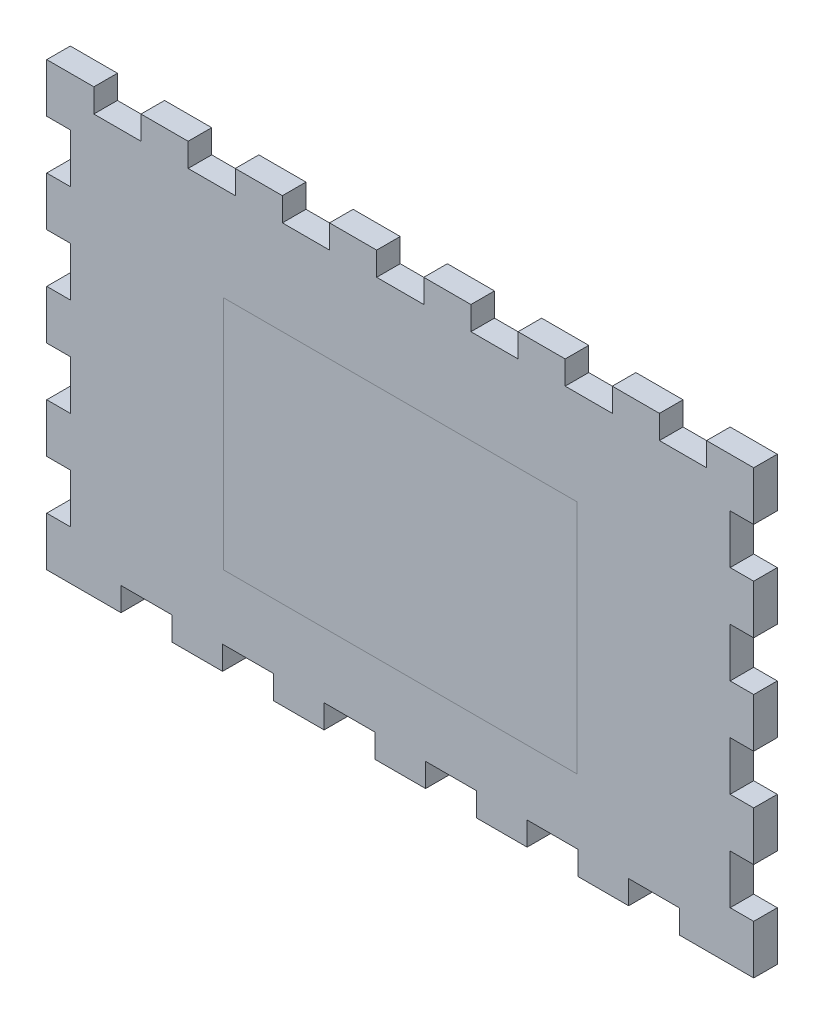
ISO-10303-21;
HEADER;
FILE_DESCRIPTION(('STEP AP214'),'2;1');
FILE_NAME('part.step','',(''),(''),'','','');
FILE_SCHEMA(('AUTOMOTIVE_DESIGN { 1 0 10303 214 1 1 1 1 }'));
ENDSEC;
DATA;
#1=APPLICATION_CONTEXT('core data for automotive mechanical design processes');
#2=APPLICATION_PROTOCOL_DEFINITION('international standard','automotive_design',2000,#1);
#3=PRODUCT_CONTEXT('',#1,'mechanical');
#4=PRODUCT('Part','Part','',(#3));
#5=PRODUCT_RELATED_PRODUCT_CATEGORY('part','',(#4));
#6=PRODUCT_DEFINITION_FORMATION('','',#4);
#7=PRODUCT_DEFINITION_CONTEXT('part definition',#1,'design');
#8=PRODUCT_DEFINITION('design','',#6,#7);
#9=PRODUCT_DEFINITION_SHAPE('','',#8);
#10=(LENGTH_UNIT() NAMED_UNIT(*) SI_UNIT(.MILLI.,.METRE.));
#11=(NAMED_UNIT(*) PLANE_ANGLE_UNIT() SI_UNIT($,.RADIAN.));
#12=(NAMED_UNIT(*) SI_UNIT($,.STERADIAN.) SOLID_ANGLE_UNIT());
#13=UNCERTAINTY_MEASURE_WITH_UNIT(LENGTH_MEASURE(1.E-05),#10,'distance_accuracy_value','');
#14=(GEOMETRIC_REPRESENTATION_CONTEXT(3) GLOBAL_UNCERTAINTY_ASSIGNED_CONTEXT((#13)) GLOBAL_UNIT_ASSIGNED_CONTEXT((#10,
#11,#12)) REPRESENTATION_CONTEXT('',''));
#15=CARTESIAN_POINT('',(0.,0.,0.));
#16=DIRECTION('',(0.,0.,1.));
#17=DIRECTION('',(1.,0.,0.));
#18=AXIS2_PLACEMENT_3D('',#15,#16,#17);
#19=CARTESIAN_POINT('',(0.,0.,4.));
#20=DIRECTION('',(0.,0.,1.));
#21=DIRECTION('',(1.,0.,0.));
#22=AXIS2_PLACEMENT_3D('',#19,#20,#21);
#23=PLANE('',#22);
#24=DIRECTION('',(0.,-1.,0.));
#25=VECTOR('',#24,1.);
#26=CARTESIAN_POINT('',(79.,0.,4.));
#27=LINE('',#26,#25);
#28=CARTESIAN_POINT('',(79.,8.33,4.));
#29=VERTEX_POINT('',#28);
#30=CARTESIAN_POINT('',(79.,0.,4.));
#31=VERTEX_POINT('',#30);
#32=EDGE_CURVE('E603',#29,#31,#27,.T.);
#33=ORIENTED_EDGE('',*,*,#32,.T.);
#34=DIRECTION('',(1.,0.,0.));
#35=VECTOR('',#34,1.);
#36=CARTESIAN_POINT('',(0.,0.,4.));
#37=LINE('',#36,#35);
#38=CARTESIAN_POINT('',(91.61,0.,4.));
#39=VERTEX_POINT('',#38);
#40=EDGE_CURVE('E592',#31,#39,#37,.T.);
#41=ORIENTED_EDGE('',*,*,#40,.T.);
#42=DIRECTION('',(0.,1.,0.));
#43=VECTOR('',#42,1.);
#44=CARTESIAN_POINT('',(91.61,0.,4.));
#45=LINE('',#44,#43);
#46=CARTESIAN_POINT('',(91.61,4.,4.));
#47=VERTEX_POINT('',#46);
#48=EDGE_CURVE('E602',#39,#47,#45,.T.);
#49=ORIENTED_EDGE('',*,*,#48,.T.);
#50=DIRECTION('',(1.,0.,0.));
#51=VECTOR('',#50,1.);
#52=CARTESIAN_POINT('',(0.,4.,4.));
#53=LINE('',#52,#51);
#54=CARTESIAN_POINT('',(100.23,4.,4.));
#55=VERTEX_POINT('',#54);
#56=EDGE_CURVE('E1265',#47,#55,#53,.T.);
#57=ORIENTED_EDGE('',*,*,#56,.T.);
#58=DIRECTION('',(0.,-1.,0.));
#59=VECTOR('',#58,1.);
#60=CARTESIAN_POINT('',(100.23,0.,4.));
#61=LINE('',#60,#59);
#62=CARTESIAN_POINT('',(100.23,0.,4.));
#63=VERTEX_POINT('',#62);
#64=EDGE_CURVE('E1758',#55,#63,#61,.T.);
#65=ORIENTED_EDGE('',*,*,#64,.T.);
#66=DIRECTION('',(1.,0.,0.));
#67=VECTOR('',#66,1.);
#68=CARTESIAN_POINT('',(0.,0.,4.));
#69=LINE('',#68,#67);
#70=CARTESIAN_POINT('',(108.85,0.,4.));
#71=VERTEX_POINT('',#70);
#72=EDGE_CURVE('E1755',#63,#71,#69,.T.);
#73=ORIENTED_EDGE('',*,*,#72,.T.);
#74=DIRECTION('',(0.,1.,0.));
#75=VECTOR('',#74,1.);
#76=CARTESIAN_POINT('',(108.85,0.,4.));
#77=LINE('',#76,#75);
#78=CARTESIAN_POINT('',(108.85,4.,4.));
#79=VERTEX_POINT('',#78);
#80=EDGE_CURVE('E1753',#71,#79,#77,.T.);
#81=ORIENTED_EDGE('',*,*,#80,.T.);
#82=DIRECTION('',(1.,0.,0.));
#83=VECTOR('',#82,1.);
#84=CARTESIAN_POINT('',(0.,4.,4.));
#85=LINE('',#84,#83);
#86=CARTESIAN_POINT('',(117.46,4.,4.));
#87=VERTEX_POINT('',#86);
#88=EDGE_CURVE('E1748',#79,#87,#85,.T.);
#89=ORIENTED_EDGE('',*,*,#88,.T.);
#90=DIRECTION('',(0.,-1.,0.));
#91=VECTOR('',#90,1.);
#92=CARTESIAN_POINT('',(117.46,0.,4.));
#93=LINE('',#92,#91);
#94=CARTESIAN_POINT('',(117.46,0.,4.));
#95=VERTEX_POINT('',#94);
#96=EDGE_CURVE('E1745',#87,#95,#93,.T.);
#97=ORIENTED_EDGE('',*,*,#96,.T.);
#98=DIRECTION('',(1.,0.,0.));
#99=VECTOR('',#98,1.);
#100=CARTESIAN_POINT('',(0.,0.,4.));
#101=LINE('',#100,#99);
#102=CARTESIAN_POINT('',(126.08,0.,4.));
#103=VERTEX_POINT('',#102);
#104=EDGE_CURVE('E1743',#95,#103,#101,.T.);
#105=ORIENTED_EDGE('',*,*,#104,.T.);
#106=DIRECTION('',(0.,1.,0.));
#107=VECTOR('',#106,1.);
#108=CARTESIAN_POINT('',(126.08,0.,4.));
#109=LINE('',#108,#107);
#110=CARTESIAN_POINT('',(126.08,4.,4.));
#111=VERTEX_POINT('',#110);
#112=EDGE_CURVE('E1736',#103,#111,#109,.T.);
#113=ORIENTED_EDGE('',*,*,#112,.T.);
#114=DIRECTION('',(1.,0.,0.));
#115=VECTOR('',#114,1.);
#116=CARTESIAN_POINT('',(0.,4.,4.));
#117=LINE('',#116,#115);
#118=CARTESIAN_POINT('',(134.69,4.,4.));
#119=VERTEX_POINT('',#118);
#120=EDGE_CURVE('E1733',#111,#119,#117,.T.);
#121=ORIENTED_EDGE('',*,*,#120,.T.);
#122=DIRECTION('',(0.,-1.,0.));
#123=VECTOR('',#122,1.);
#124=CARTESIAN_POINT('',(134.69,0.,4.));
#125=LINE('',#124,#123);
#126=CARTESIAN_POINT('',(134.69,0.,4.));
#127=VERTEX_POINT('',#126);
#128=EDGE_CURVE('E1731',#119,#127,#125,.T.);
#129=ORIENTED_EDGE('',*,*,#128,.T.);
#130=DIRECTION('',(1.,0.,0.));
#131=VECTOR('',#130,1.);
#132=CARTESIAN_POINT('',(0.,0.,4.));
#133=LINE('',#132,#131);
#134=CARTESIAN_POINT('',(143.31,0.,4.));
#135=VERTEX_POINT('',#134);
#136=EDGE_CURVE('E1724',#127,#135,#133,.T.);
#137=ORIENTED_EDGE('',*,*,#136,.T.);
#138=DIRECTION('',(0.,1.,0.));
#139=VECTOR('',#138,1.);
#140=CARTESIAN_POINT('',(143.31,0.,4.));
#141=LINE('',#140,#139);
#142=CARTESIAN_POINT('',(143.31,4.,4.));
#143=VERTEX_POINT('',#142);
#144=EDGE_CURVE('E1721',#135,#143,#141,.T.);
#145=ORIENTED_EDGE('',*,*,#144,.T.);
#146=DIRECTION('',(1.,0.,0.));
#147=VECTOR('',#146,1.);
#148=CARTESIAN_POINT('',(0.,4.,4.));
#149=LINE('',#148,#147);
#150=CARTESIAN_POINT('',(151.92,4.,4.));
#151=VERTEX_POINT('',#150);
#152=EDGE_CURVE('E1719',#143,#151,#149,.T.);
#153=ORIENTED_EDGE('',*,*,#152,.T.);
#154=DIRECTION('',(0.,-1.,0.));
#155=VECTOR('',#154,1.);
#156=CARTESIAN_POINT('',(151.92,0.,4.));
#157=LINE('',#156,#155);
#158=CARTESIAN_POINT('',(151.92,0.,4.));
#159=VERTEX_POINT('',#158);
#160=EDGE_CURVE('E1712',#151,#159,#157,.T.);
#161=ORIENTED_EDGE('',*,*,#160,.T.);
#162=DIRECTION('',(1.,0.,0.));
#163=VECTOR('',#162,1.);
#164=CARTESIAN_POINT('',(0.,0.,4.));
#165=LINE('',#164,#163);
#166=CARTESIAN_POINT('',(160.54,0.,4.));
#167=VERTEX_POINT('',#166);
#168=EDGE_CURVE('E1709',#159,#167,#165,.T.);
#169=ORIENTED_EDGE('',*,*,#168,.T.);
#170=DIRECTION('',(0.,1.,0.));
#171=VECTOR('',#170,1.);
#172=CARTESIAN_POINT('',(160.54,0.,4.));
#173=LINE('',#172,#171);
#174=CARTESIAN_POINT('',(160.54,4.,4.));
#175=VERTEX_POINT('',#174);
#176=EDGE_CURVE('E1707',#167,#175,#173,.T.);
#177=ORIENTED_EDGE('',*,*,#176,.T.);
#178=DIRECTION('',(1.,0.,0.));
#179=VECTOR('',#178,1.);
#180=CARTESIAN_POINT('',(0.,4.,4.));
#181=LINE('',#180,#179);
#182=CARTESIAN_POINT('',(169.15,4.,4.));
#183=VERTEX_POINT('',#182);
#184=EDGE_CURVE('E1700',#175,#183,#181,.T.);
#185=ORIENTED_EDGE('',*,*,#184,.T.);
#186=DIRECTION('',(0.,-1.,0.));
#187=VECTOR('',#186,1.);
#188=CARTESIAN_POINT('',(169.15,0.,4.));
#189=LINE('',#188,#187);
#190=CARTESIAN_POINT('',(169.15,0.,4.));
#191=VERTEX_POINT('',#190);
#192=EDGE_CURVE('E1697',#183,#191,#189,.T.);
#193=ORIENTED_EDGE('',*,*,#192,.T.);
#194=DIRECTION('',(1.,0.,0.));
#195=VECTOR('',#194,1.);
#196=CARTESIAN_POINT('',(0.,0.,4.));
#197=LINE('',#196,#195);
#198=CARTESIAN_POINT('',(177.77,0.,4.));
#199=VERTEX_POINT('',#198);
#200=EDGE_CURVE('E1695',#191,#199,#197,.T.);
#201=ORIENTED_EDGE('',*,*,#200,.T.);
#202=DIRECTION('',(0.,1.,0.));
#203=VECTOR('',#202,1.);
#204=CARTESIAN_POINT('',(177.77,0.,4.));
#205=LINE('',#204,#203);
#206=CARTESIAN_POINT('',(177.77,4.,4.));
#207=VERTEX_POINT('',#206);
#208=EDGE_CURVE('E1688',#199,#207,#205,.T.);
#209=ORIENTED_EDGE('',*,*,#208,.T.);
#210=DIRECTION('',(1.,0.,0.));
#211=VECTOR('',#210,1.);
#212=CARTESIAN_POINT('',(0.,4.,4.));
#213=LINE('',#212,#211);
#214=CARTESIAN_POINT('',(186.38,4.,4.));
#215=VERTEX_POINT('',#214);
#216=EDGE_CURVE('E1685',#207,#215,#213,.T.);
#217=ORIENTED_EDGE('',*,*,#216,.T.);
#218=DIRECTION('',(0.,-1.,0.));
#219=VECTOR('',#218,1.);
#220=CARTESIAN_POINT('',(186.38,0.,4.));
#221=LINE('',#220,#219);
#222=CARTESIAN_POINT('',(186.38,0.,4.));
#223=VERTEX_POINT('',#222);
#224=EDGE_CURVE('E1683',#215,#223,#221,.T.);
#225=ORIENTED_EDGE('',*,*,#224,.T.);
#226=DIRECTION('',(1.,0.,0.));
#227=VECTOR('',#226,1.);
#228=CARTESIAN_POINT('',(0.,0.,4.));
#229=LINE('',#228,#227);
#230=CARTESIAN_POINT('',(199.,0.,4.));
#231=VERTEX_POINT('',#230);
#232=EDGE_CURVE('E1676',#223,#231,#229,.T.);
#233=ORIENTED_EDGE('',*,*,#232,.T.);
#234=DIRECTION('',(0.,1.,0.));
#235=VECTOR('',#234,1.);
#236=CARTESIAN_POINT('',(199.,0.,4.));
#237=LINE('',#236,#235);
#238=CARTESIAN_POINT('',(199.,8.33,4.));
#239=VERTEX_POINT('',#238);
#240=EDGE_CURVE('E1673',#231,#239,#237,.T.);
#241=ORIENTED_EDGE('',*,*,#240,.T.);
#242=DIRECTION('',(-1.,0.,0.));
#243=VECTOR('',#242,1.);
#244=CARTESIAN_POINT('',(0.,8.33,4.));
#245=LINE('',#244,#243);
#246=CARTESIAN_POINT('',(195.,8.33,4.));
#247=VERTEX_POINT('',#246);
#248=EDGE_CURVE('E1671',#239,#247,#245,.T.);
#249=ORIENTED_EDGE('',*,*,#248,.T.);
#250=DIRECTION('',(0.,1.,0.));
#251=VECTOR('',#250,1.);
#252=CARTESIAN_POINT('',(195.,0.,4.));
#253=LINE('',#252,#251);
#254=CARTESIAN_POINT('',(195.,16.67,4.));
#255=VERTEX_POINT('',#254);
#256=EDGE_CURVE('E1664',#247,#255,#253,.T.);
#257=ORIENTED_EDGE('',*,*,#256,.T.);
#258=DIRECTION('',(1.,0.,0.));
#259=VECTOR('',#258,1.);
#260=CARTESIAN_POINT('',(0.,16.67,4.));
#261=LINE('',#260,#259);
#262=CARTESIAN_POINT('',(199.,16.67,4.));
#263=VERTEX_POINT('',#262);
#264=EDGE_CURVE('E1661',#255,#263,#261,.T.);
#265=ORIENTED_EDGE('',*,*,#264,.T.);
#266=DIRECTION('',(0.,1.,0.));
#267=VECTOR('',#266,1.);
#268=CARTESIAN_POINT('',(199.,0.,4.));
#269=LINE('',#268,#267);
#270=CARTESIAN_POINT('',(199.,25.,4.));
#271=VERTEX_POINT('',#270);
#272=EDGE_CURVE('E1659',#263,#271,#269,.T.);
#273=ORIENTED_EDGE('',*,*,#272,.T.);
#274=DIRECTION('',(-1.,0.,0.));
#275=VECTOR('',#274,1.);
#276=CARTESIAN_POINT('',(0.,25.,4.));
#277=LINE('',#276,#275);
#278=CARTESIAN_POINT('',(195.,25.,4.));
#279=VERTEX_POINT('',#278);
#280=EDGE_CURVE('E1652',#271,#279,#277,.T.);
#281=ORIENTED_EDGE('',*,*,#280,.T.);
#282=DIRECTION('',(0.,1.,0.));
#283=VECTOR('',#282,1.);
#284=CARTESIAN_POINT('',(195.,0.,4.));
#285=LINE('',#284,#283);
#286=CARTESIAN_POINT('',(195.,33.33,4.));
#287=VERTEX_POINT('',#286);
#288=EDGE_CURVE('E1649',#279,#287,#285,.T.);
#289=ORIENTED_EDGE('',*,*,#288,.T.);
#290=DIRECTION('',(1.,0.,0.));
#291=VECTOR('',#290,1.);
#292=CARTESIAN_POINT('',(0.,33.33,4.));
#293=LINE('',#292,#291);
#294=CARTESIAN_POINT('',(199.,33.33,4.));
#295=VERTEX_POINT('',#294);
#296=EDGE_CURVE('E1647',#287,#295,#293,.T.);
#297=ORIENTED_EDGE('',*,*,#296,.T.);
#298=DIRECTION('',(0.,1.,0.));
#299=VECTOR('',#298,1.);
#300=CARTESIAN_POINT('',(199.,0.,4.));
#301=LINE('',#300,#299);
#302=CARTESIAN_POINT('',(199.,41.67,4.));
#303=VERTEX_POINT('',#302);
#304=EDGE_CURVE('E1640',#295,#303,#301,.T.);
#305=ORIENTED_EDGE('',*,*,#304,.T.);
#306=DIRECTION('',(-1.,0.,0.));
#307=VECTOR('',#306,1.);
#308=CARTESIAN_POINT('',(0.,41.67,4.));
#309=LINE('',#308,#307);
#310=CARTESIAN_POINT('',(195.,41.67,4.));
#311=VERTEX_POINT('',#310);
#312=EDGE_CURVE('E1637',#303,#311,#309,.T.);
#313=ORIENTED_EDGE('',*,*,#312,.T.);
#314=DIRECTION('',(0.,1.,0.));
#315=VECTOR('',#314,1.);
#316=CARTESIAN_POINT('',(195.,0.,4.));
#317=LINE('',#316,#315);
#318=CARTESIAN_POINT('',(195.,50.,4.));
#319=VERTEX_POINT('',#318);
#320=EDGE_CURVE('E1635',#311,#319,#317,.T.);
#321=ORIENTED_EDGE('',*,*,#320,.T.);
#322=DIRECTION('',(1.,0.,0.));
#323=VECTOR('',#322,1.);
#324=CARTESIAN_POINT('',(0.,50.,4.));
#325=LINE('',#324,#323);
#326=CARTESIAN_POINT('',(199.,50.,4.));
#327=VERTEX_POINT('',#326);
#328=EDGE_CURVE('E1628',#319,#327,#325,.T.);
#329=ORIENTED_EDGE('',*,*,#328,.T.);
#330=DIRECTION('',(0.,1.,0.));
#331=VECTOR('',#330,1.);
#332=CARTESIAN_POINT('',(199.,0.,4.));
#333=LINE('',#332,#331);
#334=CARTESIAN_POINT('',(199.,58.33,4.));
#335=VERTEX_POINT('',#334);
#336=EDGE_CURVE('E1625',#327,#335,#333,.T.);
#337=ORIENTED_EDGE('',*,*,#336,.T.);
#338=DIRECTION('',(-1.,0.,0.));
#339=VECTOR('',#338,1.);
#340=CARTESIAN_POINT('',(0.,58.33,4.));
#341=LINE('',#340,#339);
#342=CARTESIAN_POINT('',(195.,58.33,4.));
#343=VERTEX_POINT('',#342);
#344=EDGE_CURVE('E1623',#335,#343,#341,.T.);
#345=ORIENTED_EDGE('',*,*,#344,.T.);
#346=DIRECTION('',(0.,1.,0.));
#347=VECTOR('',#346,1.);
#348=CARTESIAN_POINT('',(195.,0.,4.));
#349=LINE('',#348,#347);
#350=CARTESIAN_POINT('',(195.,66.67,4.));
#351=VERTEX_POINT('',#350);
#352=EDGE_CURVE('E1616',#343,#351,#349,.T.);
#353=ORIENTED_EDGE('',*,*,#352,.T.);
#354=DIRECTION('',(1.,0.,0.));
#355=VECTOR('',#354,1.);
#356=CARTESIAN_POINT('',(0.,66.67,4.));
#357=LINE('',#356,#355);
#358=CARTESIAN_POINT('',(199.,66.67,4.));
#359=VERTEX_POINT('',#358);
#360=EDGE_CURVE('E1613',#351,#359,#357,.T.);
#361=ORIENTED_EDGE('',*,*,#360,.T.);
#362=DIRECTION('',(0.,1.,0.));
#363=VECTOR('',#362,1.);
#364=CARTESIAN_POINT('',(199.,0.,4.));
#365=LINE('',#364,#363);
#366=CARTESIAN_POINT('',(199.,75.,4.));
#367=VERTEX_POINT('',#366);
#368=EDGE_CURVE('E1611',#359,#367,#365,.T.);
#369=ORIENTED_EDGE('',*,*,#368,.T.);
#370=DIRECTION('',(-1.,0.,0.));
#371=VECTOR('',#370,1.);
#372=CARTESIAN_POINT('',(0.,75.,4.));
#373=LINE('',#372,#371);
#374=CARTESIAN_POINT('',(191.,75.,4.));
#375=VERTEX_POINT('',#374);
#376=EDGE_CURVE('E1604',#367,#375,#373,.T.);
#377=ORIENTED_EDGE('',*,*,#376,.T.);
#378=DIRECTION('',(0.,-1.,0.));
#379=VECTOR('',#378,1.);
#380=CARTESIAN_POINT('',(191.,0.,4.));
#381=LINE('',#380,#379);
#382=CARTESIAN_POINT('',(191.,71.,4.));
#383=VERTEX_POINT('',#382);
#384=EDGE_CURVE('E1601',#375,#383,#381,.T.);
#385=ORIENTED_EDGE('',*,*,#384,.T.);
#386=DIRECTION('',(-1.,0.,0.));
#387=VECTOR('',#386,1.);
#388=CARTESIAN_POINT('',(0.,71.,4.));
#389=LINE('',#388,#387);
#390=CARTESIAN_POINT('',(183.,71.,4.));
#391=VERTEX_POINT('',#390);
#392=EDGE_CURVE('E1599',#383,#391,#389,.T.);
#393=ORIENTED_EDGE('',*,*,#392,.T.);
#394=DIRECTION('',(0.,1.,0.));
#395=VECTOR('',#394,1.);
#396=CARTESIAN_POINT('',(183.,0.,4.));
#397=LINE('',#396,#395);
#398=CARTESIAN_POINT('',(183.,75.,4.));
#399=VERTEX_POINT('',#398);
#400=EDGE_CURVE('E1592',#391,#399,#397,.T.);
#401=ORIENTED_EDGE('',*,*,#400,.T.);
#402=DIRECTION('',(-1.,0.,0.));
#403=VECTOR('',#402,1.);
#404=CARTESIAN_POINT('',(0.,75.,4.));
#405=LINE('',#404,#403);
#406=CARTESIAN_POINT('',(175.,75.,4.));
#407=VERTEX_POINT('',#406);
#408=EDGE_CURVE('E1589',#399,#407,#405,.T.);
#409=ORIENTED_EDGE('',*,*,#408,.T.);
#410=DIRECTION('',(0.,-1.,0.));
#411=VECTOR('',#410,1.);
#412=CARTESIAN_POINT('',(175.,0.,4.));
#413=LINE('',#412,#411);
#414=CARTESIAN_POINT('',(175.,71.,4.));
#415=VERTEX_POINT('',#414);
#416=EDGE_CURVE('E1587',#407,#415,#413,.T.);
#417=ORIENTED_EDGE('',*,*,#416,.T.);
#418=DIRECTION('',(-1.,0.,0.));
#419=VECTOR('',#418,1.);
#420=CARTESIAN_POINT('',(0.,71.,4.));
#421=LINE('',#420,#419);
#422=CARTESIAN_POINT('',(167.,71.,4.));
#423=VERTEX_POINT('',#422);
#424=EDGE_CURVE('E1580',#415,#423,#421,.T.);
#425=ORIENTED_EDGE('',*,*,#424,.T.);
#426=DIRECTION('',(0.,1.,0.));
#427=VECTOR('',#426,1.);
#428=CARTESIAN_POINT('',(167.,0.,4.));
#429=LINE('',#428,#427);
#430=CARTESIAN_POINT('',(167.,75.,4.));
#431=VERTEX_POINT('',#430);
#432=EDGE_CURVE('E1577',#423,#431,#429,.T.);
#433=ORIENTED_EDGE('',*,*,#432,.T.);
#434=DIRECTION('',(-1.,0.,0.));
#435=VECTOR('',#434,1.);
#436=CARTESIAN_POINT('',(0.,75.,4.));
#437=LINE('',#436,#435);
#438=CARTESIAN_POINT('',(159.,75.,4.));
#439=VERTEX_POINT('',#438);
#440=EDGE_CURVE('E1575',#431,#439,#437,.T.);
#441=ORIENTED_EDGE('',*,*,#440,.T.);
#442=DIRECTION('',(0.,-1.,0.));
#443=VECTOR('',#442,1.);
#444=CARTESIAN_POINT('',(159.,0.,4.));
#445=LINE('',#444,#443);
#446=CARTESIAN_POINT('',(159.,71.,4.));
#447=VERTEX_POINT('',#446);
#448=EDGE_CURVE('E1568',#439,#447,#445,.T.);
#449=ORIENTED_EDGE('',*,*,#448,.T.);
#450=DIRECTION('',(-1.,0.,0.));
#451=VECTOR('',#450,1.);
#452=CARTESIAN_POINT('',(0.,71.,4.));
#453=LINE('',#452,#451);
#454=CARTESIAN_POINT('',(151.,71.,4.));
#455=VERTEX_POINT('',#454);
#456=EDGE_CURVE('E1565',#447,#455,#453,.T.);
#457=ORIENTED_EDGE('',*,*,#456,.T.);
#458=DIRECTION('',(0.,1.,0.));
#459=VECTOR('',#458,1.);
#460=CARTESIAN_POINT('',(151.,0.,4.));
#461=LINE('',#460,#459);
#462=CARTESIAN_POINT('',(151.,75.,4.));
#463=VERTEX_POINT('',#462);
#464=EDGE_CURVE('E1563',#455,#463,#461,.T.);
#465=ORIENTED_EDGE('',*,*,#464,.T.);
#466=DIRECTION('',(-1.,0.,0.));
#467=VECTOR('',#466,1.);
#468=CARTESIAN_POINT('',(0.,75.,4.));
#469=LINE('',#468,#467);
#470=CARTESIAN_POINT('',(143.,75.,4.));
#471=VERTEX_POINT('',#470);
#472=EDGE_CURVE('E1556',#463,#471,#469,.T.);
#473=ORIENTED_EDGE('',*,*,#472,.T.);
#474=DIRECTION('',(0.,-1.,0.));
#475=VECTOR('',#474,1.);
#476=CARTESIAN_POINT('',(143.,0.,4.));
#477=LINE('',#476,#475);
#478=CARTESIAN_POINT('',(143.,71.,4.));
#479=VERTEX_POINT('',#478);
#480=EDGE_CURVE('E1553',#471,#479,#477,.T.);
#481=ORIENTED_EDGE('',*,*,#480,.T.);
#482=DIRECTION('',(-1.,0.,0.));
#483=VECTOR('',#482,1.);
#484=CARTESIAN_POINT('',(0.,71.,4.));
#485=LINE('',#484,#483);
#486=CARTESIAN_POINT('',(135.,71.,4.));
#487=VERTEX_POINT('',#486);
#488=EDGE_CURVE('E1551',#479,#487,#485,.T.);
#489=ORIENTED_EDGE('',*,*,#488,.T.);
#490=DIRECTION('',(0.,1.,0.));
#491=VECTOR('',#490,1.);
#492=CARTESIAN_POINT('',(135.,0.,4.));
#493=LINE('',#492,#491);
#494=CARTESIAN_POINT('',(135.,75.,4.));
#495=VERTEX_POINT('',#494);
#496=EDGE_CURVE('E1544',#487,#495,#493,.T.);
#497=ORIENTED_EDGE('',*,*,#496,.T.);
#498=DIRECTION('',(-1.,0.,0.));
#499=VECTOR('',#498,1.);
#500=CARTESIAN_POINT('',(0.,75.,4.));
#501=LINE('',#500,#499);
#502=CARTESIAN_POINT('',(127.,75.,4.));
#503=VERTEX_POINT('',#502);
#504=EDGE_CURVE('E1541',#495,#503,#501,.T.);
#505=ORIENTED_EDGE('',*,*,#504,.T.);
#506=DIRECTION('',(0.,-1.,0.));
#507=VECTOR('',#506,1.);
#508=CARTESIAN_POINT('',(127.,0.,4.));
#509=LINE('',#508,#507);
#510=CARTESIAN_POINT('',(127.,71.,4.));
#511=VERTEX_POINT('',#510);
#512=EDGE_CURVE('E1539',#503,#511,#509,.T.);
#513=ORIENTED_EDGE('',*,*,#512,.T.);
#514=DIRECTION('',(-1.,0.,0.));
#515=VECTOR('',#514,1.);
#516=CARTESIAN_POINT('',(0.,71.,4.));
#517=LINE('',#516,#515);
#518=CARTESIAN_POINT('',(119.,71.,4.));
#519=VERTEX_POINT('',#518);
#520=EDGE_CURVE('E1532',#511,#519,#517,.T.);
#521=ORIENTED_EDGE('',*,*,#520,.T.);
#522=DIRECTION('',(0.,1.,0.));
#523=VECTOR('',#522,1.);
#524=CARTESIAN_POINT('',(119.,0.,4.));
#525=LINE('',#524,#523);
#526=CARTESIAN_POINT('',(119.,75.,4.));
#527=VERTEX_POINT('',#526);
#528=EDGE_CURVE('E1529',#519,#527,#525,.T.);
#529=ORIENTED_EDGE('',*,*,#528,.T.);
#530=DIRECTION('',(-1.,0.,0.));
#531=VECTOR('',#530,1.);
#532=CARTESIAN_POINT('',(0.,75.,4.));
#533=LINE('',#532,#531);
#534=CARTESIAN_POINT('',(111.,75.,4.));
#535=VERTEX_POINT('',#534);
#536=EDGE_CURVE('E1527',#527,#535,#533,.T.);
#537=ORIENTED_EDGE('',*,*,#536,.T.);
#538=DIRECTION('',(0.,-1.,0.));
#539=VECTOR('',#538,1.);
#540=CARTESIAN_POINT('',(111.,0.,4.));
#541=LINE('',#540,#539);
#542=CARTESIAN_POINT('',(111.,71.,4.));
#543=VERTEX_POINT('',#542);
#544=EDGE_CURVE('E1520',#535,#543,#541,.T.);
#545=ORIENTED_EDGE('',*,*,#544,.T.);
#546=DIRECTION('',(-1.,0.,0.));
#547=VECTOR('',#546,1.);
#548=CARTESIAN_POINT('',(0.,71.,4.));
#549=LINE('',#548,#547);
#550=CARTESIAN_POINT('',(103.,71.,4.));
#551=VERTEX_POINT('',#550);
#552=EDGE_CURVE('E1517',#543,#551,#549,.T.);
#553=ORIENTED_EDGE('',*,*,#552,.T.);
#554=DIRECTION('',(0.,1.,0.));
#555=VECTOR('',#554,1.);
#556=CARTESIAN_POINT('',(103.,0.,4.));
#557=LINE('',#556,#555);
#558=CARTESIAN_POINT('',(103.,75.,4.));
#559=VERTEX_POINT('',#558);
#560=EDGE_CURVE('E1515',#551,#559,#557,.T.);
#561=ORIENTED_EDGE('',*,*,#560,.T.);
#562=DIRECTION('',(-1.,0.,0.));
#563=VECTOR('',#562,1.);
#564=CARTESIAN_POINT('',(0.,75.,4.));
#565=LINE('',#564,#563);
#566=CARTESIAN_POINT('',(95.,75.,4.));
#567=VERTEX_POINT('',#566);
#568=EDGE_CURVE('E1508',#559,#567,#565,.T.);
#569=ORIENTED_EDGE('',*,*,#568,.T.);
#570=DIRECTION('',(0.,-1.,0.));
#571=VECTOR('',#570,1.);
#572=CARTESIAN_POINT('',(95.,0.,4.));
#573=LINE('',#572,#571);
#574=CARTESIAN_POINT('',(95.,71.,4.));
#575=VERTEX_POINT('',#574);
#576=EDGE_CURVE('E1505',#567,#575,#573,.T.);
#577=ORIENTED_EDGE('',*,*,#576,.T.);
#578=DIRECTION('',(-1.,0.,0.));
#579=VECTOR('',#578,1.);
#580=CARTESIAN_POINT('',(0.,71.,4.));
#581=LINE('',#580,#579);
#582=CARTESIAN_POINT('',(87.,71.,4.));
#583=VERTEX_POINT('',#582);
#584=EDGE_CURVE('E1503',#575,#583,#581,.T.);
#585=ORIENTED_EDGE('',*,*,#584,.T.);
#586=DIRECTION('',(0.,1.,0.));
#587=VECTOR('',#586,1.);
#588=CARTESIAN_POINT('',(87.,0.,4.));
#589=LINE('',#588,#587);
#590=CARTESIAN_POINT('',(87.,75.,4.));
#591=VERTEX_POINT('',#590);
#592=EDGE_CURVE('E1496',#583,#591,#589,.T.);
#593=ORIENTED_EDGE('',*,*,#592,.T.);
#594=DIRECTION('',(-1.,0.,0.));
#595=VECTOR('',#594,1.);
#596=CARTESIAN_POINT('',(0.,75.,4.));
#597=LINE('',#596,#595);
#598=CARTESIAN_POINT('',(79.,75.,4.));
#599=VERTEX_POINT('',#598);
#600=EDGE_CURVE('E1493',#591,#599,#597,.T.);
#601=ORIENTED_EDGE('',*,*,#600,.T.);
#602=DIRECTION('',(0.,-1.,0.));
#603=VECTOR('',#602,1.);
#604=CARTESIAN_POINT('',(79.,0.,4.));
#605=LINE('',#604,#603);
#606=CARTESIAN_POINT('',(79.,66.67,4.));
#607=VERTEX_POINT('',#606);
#608=EDGE_CURVE('E1491',#599,#607,#605,.T.);
#609=ORIENTED_EDGE('',*,*,#608,.T.);
#610=DIRECTION('',(1.,0.,0.));
#611=VECTOR('',#610,1.);
#612=CARTESIAN_POINT('',(0.,66.67,4.));
#613=LINE('',#612,#611);
#614=CARTESIAN_POINT('',(83.,66.67,4.));
#615=VERTEX_POINT('',#614);
#616=EDGE_CURVE('E1484',#607,#615,#613,.T.);
#617=ORIENTED_EDGE('',*,*,#616,.T.);
#618=DIRECTION('',(0.,-1.,0.));
#619=VECTOR('',#618,1.);
#620=CARTESIAN_POINT('',(83.,0.,4.));
#621=LINE('',#620,#619);
#622=CARTESIAN_POINT('',(83.,58.33,4.));
#623=VERTEX_POINT('',#622);
#624=EDGE_CURVE('E1481',#615,#623,#621,.T.);
#625=ORIENTED_EDGE('',*,*,#624,.T.);
#626=DIRECTION('',(-1.,0.,0.));
#627=VECTOR('',#626,1.);
#628=CARTESIAN_POINT('',(0.,58.33,4.));
#629=LINE('',#628,#627);
#630=CARTESIAN_POINT('',(79.,58.33,4.));
#631=VERTEX_POINT('',#630);
#632=EDGE_CURVE('E1479',#623,#631,#629,.T.);
#633=ORIENTED_EDGE('',*,*,#632,.T.);
#634=DIRECTION('',(0.,-1.,0.));
#635=VECTOR('',#634,1.);
#636=CARTESIAN_POINT('',(79.,0.,4.));
#637=LINE('',#636,#635);
#638=CARTESIAN_POINT('',(79.,50.,4.));
#639=VERTEX_POINT('',#638);
#640=EDGE_CURVE('E1472',#631,#639,#637,.T.);
#641=ORIENTED_EDGE('',*,*,#640,.T.);
#642=DIRECTION('',(1.,0.,0.));
#643=VECTOR('',#642,1.);
#644=CARTESIAN_POINT('',(0.,50.,4.));
#645=LINE('',#644,#643);
#646=CARTESIAN_POINT('',(83.,50.,4.));
#647=VERTEX_POINT('',#646);
#648=EDGE_CURVE('E1469',#639,#647,#645,.T.);
#649=ORIENTED_EDGE('',*,*,#648,.T.);
#650=DIRECTION('',(0.,-1.,0.));
#651=VECTOR('',#650,1.);
#652=CARTESIAN_POINT('',(83.,0.,4.));
#653=LINE('',#652,#651);
#654=CARTESIAN_POINT('',(83.,41.67,4.));
#655=VERTEX_POINT('',#654);
#656=EDGE_CURVE('E1467',#647,#655,#653,.T.);
#657=ORIENTED_EDGE('',*,*,#656,.T.);
#658=DIRECTION('',(-1.,0.,0.));
#659=VECTOR('',#658,1.);
#660=CARTESIAN_POINT('',(0.,41.67,4.));
#661=LINE('',#660,#659);
#662=CARTESIAN_POINT('',(79.,41.67,4.));
#663=VERTEX_POINT('',#662);
#664=EDGE_CURVE('E1460',#655,#663,#661,.T.);
#665=ORIENTED_EDGE('',*,*,#664,.T.);
#666=DIRECTION('',(0.,-1.,0.));
#667=VECTOR('',#666,1.);
#668=CARTESIAN_POINT('',(79.,0.,4.));
#669=LINE('',#668,#667);
#670=CARTESIAN_POINT('',(79.,33.33,4.));
#671=VERTEX_POINT('',#670);
#672=EDGE_CURVE('E1457',#663,#671,#669,.T.);
#673=ORIENTED_EDGE('',*,*,#672,.T.);
#674=DIRECTION('',(1.,0.,0.));
#675=VECTOR('',#674,1.);
#676=CARTESIAN_POINT('',(0.,33.33,4.));
#677=LINE('',#676,#675);
#678=CARTESIAN_POINT('',(83.,33.33,4.));
#679=VERTEX_POINT('',#678);
#680=EDGE_CURVE('E1455',#671,#679,#677,.T.);
#681=ORIENTED_EDGE('',*,*,#680,.T.);
#682=DIRECTION('',(0.,-1.,0.));
#683=VECTOR('',#682,1.);
#684=CARTESIAN_POINT('',(83.,0.,4.));
#685=LINE('',#684,#683);
#686=CARTESIAN_POINT('',(83.,25.,4.));
#687=VERTEX_POINT('',#686);
#688=EDGE_CURVE('E1448',#679,#687,#685,.T.);
#689=ORIENTED_EDGE('',*,*,#688,.T.);
#690=DIRECTION('',(-1.,0.,0.));
#691=VECTOR('',#690,1.);
#692=CARTESIAN_POINT('',(0.,25.,4.));
#693=LINE('',#692,#691);
#694=CARTESIAN_POINT('',(79.,25.,4.));
#695=VERTEX_POINT('',#694);
#696=EDGE_CURVE('E1445',#687,#695,#693,.T.);
#697=ORIENTED_EDGE('',*,*,#696,.T.);
#698=DIRECTION('',(0.,-1.,0.));
#699=VECTOR('',#698,1.);
#700=CARTESIAN_POINT('',(79.,0.,4.));
#701=LINE('',#700,#699);
#702=CARTESIAN_POINT('',(79.,16.67,4.));
#703=VERTEX_POINT('',#702);
#704=EDGE_CURVE('E1443',#695,#703,#701,.T.);
#705=ORIENTED_EDGE('',*,*,#704,.T.);
#706=DIRECTION('',(1.,0.,0.));
#707=VECTOR('',#706,1.);
#708=CARTESIAN_POINT('',(0.,16.67,4.));
#709=LINE('',#708,#707);
#710=CARTESIAN_POINT('',(83.,16.67,4.));
#711=VERTEX_POINT('',#710);
#712=EDGE_CURVE('E1843',#703,#711,#709,.T.);
#713=ORIENTED_EDGE('',*,*,#712,.T.);
#714=DIRECTION('',(0.,-1.,0.));
#715=VECTOR('',#714,1.);
#716=CARTESIAN_POINT('',(83.,0.,4.));
#717=LINE('',#716,#715);
#718=CARTESIAN_POINT('',(83.,8.33,4.));
#719=VERTEX_POINT('',#718);
#720=EDGE_CURVE('E1845',#711,#719,#717,.T.);
#721=ORIENTED_EDGE('',*,*,#720,.T.);
#722=DIRECTION('',(-1.,0.,0.));
#723=VECTOR('',#722,1.);
#724=CARTESIAN_POINT('',(0.,8.33,4.));
#725=LINE('',#724,#723);
#726=EDGE_CURVE('E608',#719,#29,#725,.T.);
#727=ORIENTED_EDGE('',*,*,#726,.T.);
#728=EDGE_LOOP('',(#33,#41,#49,#57,#65,#73,#81,#89,#97,#105,#113,#121,#129,#137,#145,#153,#161,
#169,#177,#185,#193,#201,#209,#217,#225,#233,#241,#249,#257,#265,#273,#281,#289,#297,#305,#313,
#321,#329,#337,#345,#353,#361,#369,#377,#385,#393,#401,#409,#417,#425,#433,#441,#449,#457,#465,
#473,#481,#489,#497,#505,#513,#521,#529,#537,#545,#553,#561,#569,#577,#585,#593,#601,#609,#617,
#625,#633,#641,#649,#657,#665,#673,#681,#689,#697,#705,#713,#721,#727));
#729=FACE_BOUND('',#728,.T.);
#730=DIRECTION('',(-1.,0.,0.));
#731=VECTOR('',#730,1.);
#732=CARTESIAN_POINT('',(0.,15.,4.));
#733=LINE('',#732,#731);
#734=CARTESIAN_POINT('',(169.,15.,4.));
#735=VERTEX_POINT('',#734);
#736=CARTESIAN_POINT('',(109.,15.,4.));
#737=VERTEX_POINT('',#736);
#738=EDGE_CURVE('E48',#735,#737,#733,.T.);
#739=ORIENTED_EDGE('',*,*,#738,.T.);
#740=DIRECTION('',(0.,1.,0.));
#741=VECTOR('',#740,1.);
#742=CARTESIAN_POINT('',(109.,0.,4.));
#743=LINE('',#742,#741);
#744=CARTESIAN_POINT('',(109.,55.,4.));
#745=VERTEX_POINT('',#744);
#746=EDGE_CURVE('E11',#737,#745,#743,.T.);
#747=ORIENTED_EDGE('',*,*,#746,.T.);
#748=DIRECTION('',(1.,0.,0.));
#749=VECTOR('',#748,1.);
#750=CARTESIAN_POINT('',(0.,55.,4.));
#751=LINE('',#750,#749);
#752=CARTESIAN_POINT('',(169.,55.,4.));
#753=VERTEX_POINT('',#752);
#754=EDGE_CURVE('E616',#745,#753,#751,.T.);
#755=ORIENTED_EDGE('',*,*,#754,.T.);
#756=DIRECTION('',(0.,-1.,0.));
#757=VECTOR('',#756,1.);
#758=CARTESIAN_POINT('',(169.,0.,4.));
#759=LINE('',#758,#757);
#760=EDGE_CURVE('E620',#753,#735,#759,.T.);
#761=ORIENTED_EDGE('',*,*,#760,.T.);
#762=EDGE_LOOP('',(#739,#747,#755,#761));
#763=FACE_BOUND('',#762,.T.);
#764=ADVANCED_FACE('F39',(#729,#763),#23,.T.);
#765=CARTESIAN_POINT('',(79.,0.,4.));
#766=DIRECTION('',(1.,0.,0.));
#767=DIRECTION('',(0.,0.,-1.));
#768=AXIS2_PLACEMENT_3D('',#765,#766,#767);
#769=PLANE('',#768);
#770=DIRECTION('',(0.,-1.,0.));
#771=VECTOR('',#770,1.);
#772=CARTESIAN_POINT('',(79.,0.,0.));
#773=LINE('',#772,#771);
#774=CARTESIAN_POINT('',(79.,8.33,0.));
#775=VERTEX_POINT('',#774);
#776=CARTESIAN_POINT('',(79.,0.,0.));
#777=VERTEX_POINT('',#776);
#778=EDGE_CURVE('E615',#775,#777,#773,.T.);
#779=ORIENTED_EDGE('',*,*,#778,.T.);
#780=DIRECTION('',(0.,0.,-1.));
#781=VECTOR('',#780,1.);
#782=CARTESIAN_POINT('',(79.,0.,4.));
#783=LINE('',#782,#781);
#784=EDGE_CURVE('E596',#31,#777,#783,.T.);
#785=ORIENTED_EDGE('',*,*,#784,.F.);
#786=ORIENTED_EDGE('',*,*,#32,.F.);
#787=DIRECTION('',(0.,0.,-1.));
#788=VECTOR('',#787,1.);
#789=CARTESIAN_POINT('',(79.,8.33,4.));
#790=LINE('',#789,#788);
#791=EDGE_CURVE('E1007',#29,#775,#790,.T.);
#792=ORIENTED_EDGE('',*,*,#791,.T.);
#793=EDGE_LOOP('',(#779,#785,#786,#792));
#794=FACE_BOUND('',#793,.T.);
#795=ADVANCED_FACE('F41',(#794),#769,.F.);
#796=CARTESIAN_POINT('',(0.,0.,4.));
#797=DIRECTION('',(0.,1.,0.));
#798=DIRECTION('',(0.,0.,1.));
#799=AXIS2_PLACEMENT_3D('',#796,#797,#798);
#800=PLANE('',#799);
#801=DIRECTION('',(1.,0.,0.));
#802=VECTOR('',#801,1.);
#803=CARTESIAN_POINT('',(0.,0.,0.));
#804=LINE('',#803,#802);
#805=CARTESIAN_POINT('',(91.61,0.,0.));
#806=VERTEX_POINT('',#805);
#807=EDGE_CURVE('E1274',#777,#806,#804,.T.);
#808=ORIENTED_EDGE('',*,*,#807,.T.);
#809=DIRECTION('',(0.,0.,-1.));
#810=VECTOR('',#809,1.);
#811=CARTESIAN_POINT('',(91.61,0.,4.));
#812=LINE('',#811,#810);
#813=EDGE_CURVE('E599',#39,#806,#812,.T.);
#814=ORIENTED_EDGE('',*,*,#813,.F.);
#815=ORIENTED_EDGE('',*,*,#40,.F.);
#816=ORIENTED_EDGE('',*,*,#784,.T.);
#817=EDGE_LOOP('',(#808,#814,#815,#816));
#818=FACE_BOUND('',#817,.T.);
#819=ADVANCED_FACE('F594',(#818),#800,.F.);
#820=CARTESIAN_POINT('',(91.61,0.,4.));
#821=DIRECTION('',(-1.,0.,0.));
#822=DIRECTION('',(0.,0.,1.));
#823=AXIS2_PLACEMENT_3D('',#820,#821,#822);
#824=PLANE('',#823);
#825=DIRECTION('',(0.,1.,0.));
#826=VECTOR('',#825,1.);
#827=CARTESIAN_POINT('',(91.61,0.,0.));
#828=LINE('',#827,#826);
#829=CARTESIAN_POINT('',(91.61,4.,0.));
#830=VERTEX_POINT('',#829);
#831=EDGE_CURVE('E1268',#806,#830,#828,.T.);
#832=ORIENTED_EDGE('',*,*,#831,.T.);
#833=DIRECTION('',(0.,0.,-1.));
#834=VECTOR('',#833,1.);
#835=CARTESIAN_POINT('',(91.61,4.,4.));
#836=LINE('',#835,#834);
#837=EDGE_CURVE('E622',#47,#830,#836,.T.);
#838=ORIENTED_EDGE('',*,*,#837,.F.);
#839=ORIENTED_EDGE('',*,*,#48,.F.);
#840=ORIENTED_EDGE('',*,*,#813,.T.);
#841=EDGE_LOOP('',(#832,#838,#839,#840));
#842=FACE_BOUND('',#841,.T.);
#843=ADVANCED_FACE('F651',(#842),#824,.F.);
#844=CARTESIAN_POINT('',(0.,4.,4.));
#845=DIRECTION('',(0.,1.,0.));
#846=DIRECTION('',(0.,0.,1.));
#847=AXIS2_PLACEMENT_3D('',#844,#845,#846);
#848=PLANE('',#847);
#849=DIRECTION('',(1.,0.,0.));
#850=VECTOR('',#849,1.);
#851=CARTESIAN_POINT('',(0.,4.,0.));
#852=LINE('',#851,#850);
#853=CARTESIAN_POINT('',(100.23,4.,0.));
#854=VERTEX_POINT('',#853);
#855=EDGE_CURVE('E1264',#830,#854,#852,.T.);
#856=ORIENTED_EDGE('',*,*,#855,.T.);
#857=DIRECTION('',(0.,0.,-1.));
#858=VECTOR('',#857,1.);
#859=CARTESIAN_POINT('',(100.23,4.,4.));
#860=LINE('',#859,#858);
#861=EDGE_CURVE('E1257',#55,#854,#860,.T.);
#862=ORIENTED_EDGE('',*,*,#861,.F.);
#863=ORIENTED_EDGE('',*,*,#56,.F.);
#864=ORIENTED_EDGE('',*,*,#837,.T.);
#865=EDGE_LOOP('',(#856,#862,#863,#864));
#866=FACE_BOUND('',#865,.T.);
#867=ADVANCED_FACE('F655',(#866),#848,.F.);
#868=CARTESIAN_POINT('',(100.23,0.,4.));
#869=DIRECTION('',(1.,0.,0.));
#870=DIRECTION('',(0.,0.,-1.));
#871=AXIS2_PLACEMENT_3D('',#868,#869,#870);
#872=PLANE('',#871);
#873=DIRECTION('',(0.,-1.,0.));
#874=VECTOR('',#873,1.);
#875=CARTESIAN_POINT('',(100.23,0.,0.));
#876=LINE('',#875,#874);
#877=CARTESIAN_POINT('',(100.23,0.,0.));
#878=VERTEX_POINT('',#877);
#879=EDGE_CURVE('E1270',#854,#878,#876,.T.);
#880=ORIENTED_EDGE('',*,*,#879,.T.);
#881=DIRECTION('',(0.,0.,-1.));
#882=VECTOR('',#881,1.);
#883=CARTESIAN_POINT('',(100.23,0.,4.));
#884=LINE('',#883,#882);
#885=EDGE_CURVE('E1254',#63,#878,#884,.T.);
#886=ORIENTED_EDGE('',*,*,#885,.F.);
#887=ORIENTED_EDGE('',*,*,#64,.F.);
#888=ORIENTED_EDGE('',*,*,#861,.T.);
#889=EDGE_LOOP('',(#880,#886,#887,#888));
#890=FACE_BOUND('',#889,.T.);
#891=ADVANCED_FACE('F661',(#890),#872,.F.);
#892=CARTESIAN_POINT('',(0.,0.,4.));
#893=DIRECTION('',(0.,1.,0.));
#894=DIRECTION('',(0.,0.,1.));
#895=AXIS2_PLACEMENT_3D('',#892,#893,#894);
#896=PLANE('',#895);
#897=DIRECTION('',(1.,0.,0.));
#898=VECTOR('',#897,1.);
#899=CARTESIAN_POINT('',(0.,0.,0.));
#900=LINE('',#899,#898);
#901=CARTESIAN_POINT('',(108.85,0.,0.));
#902=VERTEX_POINT('',#901);
#903=EDGE_CURVE('E1272',#878,#902,#900,.T.);
#904=ORIENTED_EDGE('',*,*,#903,.T.);
#905=DIRECTION('',(0.,0.,-1.));
#906=VECTOR('',#905,1.);
#907=CARTESIAN_POINT('',(108.85,0.,4.));
#908=LINE('',#907,#906);
#909=EDGE_CURVE('E1251',#71,#902,#908,.T.);
#910=ORIENTED_EDGE('',*,*,#909,.F.);
#911=ORIENTED_EDGE('',*,*,#72,.F.);
#912=ORIENTED_EDGE('',*,*,#885,.T.);
#913=EDGE_LOOP('',(#904,#910,#911,#912));
#914=FACE_BOUND('',#913,.T.);
#915=ADVANCED_FACE('F665',(#914),#896,.F.);
#916=CARTESIAN_POINT('',(108.85,0.,4.));
#917=DIRECTION('',(-1.,0.,0.));
#918=DIRECTION('',(0.,0.,1.));
#919=AXIS2_PLACEMENT_3D('',#916,#917,#918);
#920=PLANE('',#919);
#921=DIRECTION('',(0.,1.,0.));
#922=VECTOR('',#921,1.);
#923=CARTESIAN_POINT('',(108.85,0.,0.));
#924=LINE('',#923,#922);
#925=CARTESIAN_POINT('',(108.85,4.,0.));
#926=VERTEX_POINT('',#925);
#927=EDGE_CURVE('E1279',#902,#926,#924,.T.);
#928=ORIENTED_EDGE('',*,*,#927,.T.);
#929=DIRECTION('',(0.,0.,-1.));
#930=VECTOR('',#929,1.);
#931=CARTESIAN_POINT('',(108.85,4.,4.));
#932=LINE('',#931,#930);
#933=EDGE_CURVE('E1248',#79,#926,#932,.T.);
#934=ORIENTED_EDGE('',*,*,#933,.F.);
#935=ORIENTED_EDGE('',*,*,#80,.F.);
#936=ORIENTED_EDGE('',*,*,#909,.T.);
#937=EDGE_LOOP('',(#928,#934,#935,#936));
#938=FACE_BOUND('',#937,.T.);
#939=ADVANCED_FACE('F669',(#938),#920,.F.);
#940=CARTESIAN_POINT('',(0.,4.,4.));
#941=DIRECTION('',(0.,1.,0.));
#942=DIRECTION('',(0.,0.,1.));
#943=AXIS2_PLACEMENT_3D('',#940,#941,#942);
#944=PLANE('',#943);
#945=DIRECTION('',(1.,0.,0.));
#946=VECTOR('',#945,1.);
#947=CARTESIAN_POINT('',(0.,4.,0.));
#948=LINE('',#947,#946);
#949=CARTESIAN_POINT('',(117.46,4.,0.));
#950=VERTEX_POINT('',#949);
#951=EDGE_CURVE('E1281',#926,#950,#948,.T.);
#952=ORIENTED_EDGE('',*,*,#951,.T.);
#953=DIRECTION('',(0.,0.,-1.));
#954=VECTOR('',#953,1.);
#955=CARTESIAN_POINT('',(117.46,4.,4.));
#956=LINE('',#955,#954);
#957=EDGE_CURVE('E1245',#87,#950,#956,.T.);
#958=ORIENTED_EDGE('',*,*,#957,.F.);
#959=ORIENTED_EDGE('',*,*,#88,.F.);
#960=ORIENTED_EDGE('',*,*,#933,.T.);
#961=EDGE_LOOP('',(#952,#958,#959,#960));
#962=FACE_BOUND('',#961,.T.);
#963=ADVANCED_FACE('F673',(#962),#944,.F.);
#964=CARTESIAN_POINT('',(117.46,0.,4.));
#965=DIRECTION('',(1.,0.,0.));
#966=DIRECTION('',(0.,0.,-1.));
#967=AXIS2_PLACEMENT_3D('',#964,#965,#966);
#968=PLANE('',#967);
#969=DIRECTION('',(0.,-1.,0.));
#970=VECTOR('',#969,1.);
#971=CARTESIAN_POINT('',(117.46,0.,0.));
#972=LINE('',#971,#970);
#973=CARTESIAN_POINT('',(117.46,0.,0.));
#974=VERTEX_POINT('',#973);
#975=EDGE_CURVE('E1283',#950,#974,#972,.T.);
#976=ORIENTED_EDGE('',*,*,#975,.T.);
#977=DIRECTION('',(0.,0.,-1.));
#978=VECTOR('',#977,1.);
#979=CARTESIAN_POINT('',(117.46,0.,4.));
#980=LINE('',#979,#978);
#981=EDGE_CURVE('E1242',#95,#974,#980,.T.);
#982=ORIENTED_EDGE('',*,*,#981,.F.);
#983=ORIENTED_EDGE('',*,*,#96,.F.);
#984=ORIENTED_EDGE('',*,*,#957,.T.);
#985=EDGE_LOOP('',(#976,#982,#983,#984));
#986=FACE_BOUND('',#985,.T.);
#987=ADVANCED_FACE('F677',(#986),#968,.F.);
#988=CARTESIAN_POINT('',(0.,0.,4.));
#989=DIRECTION('',(0.,1.,0.));
#990=DIRECTION('',(0.,0.,1.));
#991=AXIS2_PLACEMENT_3D('',#988,#989,#990);
#992=PLANE('',#991);
#993=DIRECTION('',(1.,0.,0.));
#994=VECTOR('',#993,1.);
#995=CARTESIAN_POINT('',(0.,0.,0.));
#996=LINE('',#995,#994);
#997=CARTESIAN_POINT('',(126.08,0.,0.));
#998=VERTEX_POINT('',#997);
#999=EDGE_CURVE('E1285',#974,#998,#996,.T.);
#1000=ORIENTED_EDGE('',*,*,#999,.T.);
#1001=DIRECTION('',(0.,0.,-1.));
#1002=VECTOR('',#1001,1.);
#1003=CARTESIAN_POINT('',(126.08,0.,4.));
#1004=LINE('',#1003,#1002);
#1005=EDGE_CURVE('E1239',#103,#998,#1004,.T.);
#1006=ORIENTED_EDGE('',*,*,#1005,.F.);
#1007=ORIENTED_EDGE('',*,*,#104,.F.);
#1008=ORIENTED_EDGE('',*,*,#981,.T.);
#1009=EDGE_LOOP('',(#1000,#1006,#1007,#1008));
#1010=FACE_BOUND('',#1009,.T.);
#1011=ADVANCED_FACE('F681',(#1010),#992,.F.);
#1012=CARTESIAN_POINT('',(126.08,0.,4.));
#1013=DIRECTION('',(-1.,0.,0.));
#1014=DIRECTION('',(0.,0.,1.));
#1015=AXIS2_PLACEMENT_3D('',#1012,#1013,#1014);
#1016=PLANE('',#1015);
#1017=DIRECTION('',(0.,1.,0.));
#1018=VECTOR('',#1017,1.);
#1019=CARTESIAN_POINT('',(126.08,0.,0.));
#1020=LINE('',#1019,#1018);
#1021=CARTESIAN_POINT('',(126.08,4.,0.));
#1022=VERTEX_POINT('',#1021);
#1023=EDGE_CURVE('E1287',#998,#1022,#1020,.T.);
#1024=ORIENTED_EDGE('',*,*,#1023,.T.);
#1025=DIRECTION('',(0.,0.,-1.));
#1026=VECTOR('',#1025,1.);
#1027=CARTESIAN_POINT('',(126.08,4.,4.));
#1028=LINE('',#1027,#1026);
#1029=EDGE_CURVE('E1236',#111,#1022,#1028,.T.);
#1030=ORIENTED_EDGE('',*,*,#1029,.F.);
#1031=ORIENTED_EDGE('',*,*,#112,.F.);
#1032=ORIENTED_EDGE('',*,*,#1005,.T.);
#1033=EDGE_LOOP('',(#1024,#1030,#1031,#1032));
#1034=FACE_BOUND('',#1033,.T.);
#1035=ADVANCED_FACE('F685',(#1034),#1016,.F.);
#1036=CARTESIAN_POINT('',(0.,4.,4.));
#1037=DIRECTION('',(0.,1.,0.));
#1038=DIRECTION('',(0.,0.,1.));
#1039=AXIS2_PLACEMENT_3D('',#1036,#1037,#1038);
#1040=PLANE('',#1039);
#1041=DIRECTION('',(1.,0.,0.));
#1042=VECTOR('',#1041,1.);
#1043=CARTESIAN_POINT('',(0.,4.,0.));
#1044=LINE('',#1043,#1042);
#1045=CARTESIAN_POINT('',(134.69,4.,0.));
#1046=VERTEX_POINT('',#1045);
#1047=EDGE_CURVE('E1289',#1022,#1046,#1044,.T.);
#1048=ORIENTED_EDGE('',*,*,#1047,.T.);
#1049=DIRECTION('',(0.,0.,-1.));
#1050=VECTOR('',#1049,1.);
#1051=CARTESIAN_POINT('',(134.69,4.,4.));
#1052=LINE('',#1051,#1050);
#1053=EDGE_CURVE('E1233',#119,#1046,#1052,.T.);
#1054=ORIENTED_EDGE('',*,*,#1053,.F.);
#1055=ORIENTED_EDGE('',*,*,#120,.F.);
#1056=ORIENTED_EDGE('',*,*,#1029,.T.);
#1057=EDGE_LOOP('',(#1048,#1054,#1055,#1056));
#1058=FACE_BOUND('',#1057,.T.);
#1059=ADVANCED_FACE('F689',(#1058),#1040,.F.);
#1060=CARTESIAN_POINT('',(134.69,0.,4.));
#1061=DIRECTION('',(1.,0.,0.));
#1062=DIRECTION('',(0.,0.,-1.));
#1063=AXIS2_PLACEMENT_3D('',#1060,#1061,#1062);
#1064=PLANE('',#1063);
#1065=DIRECTION('',(0.,-1.,0.));
#1066=VECTOR('',#1065,1.);
#1067=CARTESIAN_POINT('',(134.69,0.,0.));
#1068=LINE('',#1067,#1066);
#1069=CARTESIAN_POINT('',(134.69,0.,0.));
#1070=VERTEX_POINT('',#1069);
#1071=EDGE_CURVE('E1291',#1046,#1070,#1068,.T.);
#1072=ORIENTED_EDGE('',*,*,#1071,.T.);
#1073=DIRECTION('',(0.,0.,-1.));
#1074=VECTOR('',#1073,1.);
#1075=CARTESIAN_POINT('',(134.69,0.,4.));
#1076=LINE('',#1075,#1074);
#1077=EDGE_CURVE('E1230',#127,#1070,#1076,.T.);
#1078=ORIENTED_EDGE('',*,*,#1077,.F.);
#1079=ORIENTED_EDGE('',*,*,#128,.F.);
#1080=ORIENTED_EDGE('',*,*,#1053,.T.);
#1081=EDGE_LOOP('',(#1072,#1078,#1079,#1080));
#1082=FACE_BOUND('',#1081,.T.);
#1083=ADVANCED_FACE('F693',(#1082),#1064,.F.);
#1084=CARTESIAN_POINT('',(0.,0.,4.));
#1085=DIRECTION('',(0.,1.,0.));
#1086=DIRECTION('',(0.,0.,1.));
#1087=AXIS2_PLACEMENT_3D('',#1084,#1085,#1086);
#1088=PLANE('',#1087);
#1089=DIRECTION('',(1.,0.,0.));
#1090=VECTOR('',#1089,1.);
#1091=CARTESIAN_POINT('',(0.,0.,0.));
#1092=LINE('',#1091,#1090);
#1093=CARTESIAN_POINT('',(143.31,0.,0.));
#1094=VERTEX_POINT('',#1093);
#1095=EDGE_CURVE('E1293',#1070,#1094,#1092,.T.);
#1096=ORIENTED_EDGE('',*,*,#1095,.T.);
#1097=DIRECTION('',(0.,0.,-1.));
#1098=VECTOR('',#1097,1.);
#1099=CARTESIAN_POINT('',(143.31,0.,4.));
#1100=LINE('',#1099,#1098);
#1101=EDGE_CURVE('E1227',#135,#1094,#1100,.T.);
#1102=ORIENTED_EDGE('',*,*,#1101,.F.);
#1103=ORIENTED_EDGE('',*,*,#136,.F.);
#1104=ORIENTED_EDGE('',*,*,#1077,.T.);
#1105=EDGE_LOOP('',(#1096,#1102,#1103,#1104));
#1106=FACE_BOUND('',#1105,.T.);
#1107=ADVANCED_FACE('F697',(#1106),#1088,.F.);
#1108=CARTESIAN_POINT('',(143.31,0.,4.));
#1109=DIRECTION('',(-1.,0.,0.));
#1110=DIRECTION('',(0.,0.,1.));
#1111=AXIS2_PLACEMENT_3D('',#1108,#1109,#1110);
#1112=PLANE('',#1111);
#1113=DIRECTION('',(0.,1.,0.));
#1114=VECTOR('',#1113,1.);
#1115=CARTESIAN_POINT('',(143.31,0.,0.));
#1116=LINE('',#1115,#1114);
#1117=CARTESIAN_POINT('',(143.31,4.,0.));
#1118=VERTEX_POINT('',#1117);
#1119=EDGE_CURVE('E1295',#1094,#1118,#1116,.T.);
#1120=ORIENTED_EDGE('',*,*,#1119,.T.);
#1121=DIRECTION('',(0.,0.,-1.));
#1122=VECTOR('',#1121,1.);
#1123=CARTESIAN_POINT('',(143.31,4.,4.));
#1124=LINE('',#1123,#1122);
#1125=EDGE_CURVE('E1224',#143,#1118,#1124,.T.);
#1126=ORIENTED_EDGE('',*,*,#1125,.F.);
#1127=ORIENTED_EDGE('',*,*,#144,.F.);
#1128=ORIENTED_EDGE('',*,*,#1101,.T.);
#1129=EDGE_LOOP('',(#1120,#1126,#1127,#1128));
#1130=FACE_BOUND('',#1129,.T.);
#1131=ADVANCED_FACE('F701',(#1130),#1112,.F.);
#1132=CARTESIAN_POINT('',(0.,4.,4.));
#1133=DIRECTION('',(0.,1.,0.));
#1134=DIRECTION('',(0.,0.,1.));
#1135=AXIS2_PLACEMENT_3D('',#1132,#1133,#1134);
#1136=PLANE('',#1135);
#1137=DIRECTION('',(1.,0.,0.));
#1138=VECTOR('',#1137,1.);
#1139=CARTESIAN_POINT('',(0.,4.,0.));
#1140=LINE('',#1139,#1138);
#1141=CARTESIAN_POINT('',(151.92,4.,0.));
#1142=VERTEX_POINT('',#1141);
#1143=EDGE_CURVE('E1297',#1118,#1142,#1140,.T.);
#1144=ORIENTED_EDGE('',*,*,#1143,.T.);
#1145=DIRECTION('',(0.,0.,-1.));
#1146=VECTOR('',#1145,1.);
#1147=CARTESIAN_POINT('',(151.92,4.,4.));
#1148=LINE('',#1147,#1146);
#1149=EDGE_CURVE('E1221',#151,#1142,#1148,.T.);
#1150=ORIENTED_EDGE('',*,*,#1149,.F.);
#1151=ORIENTED_EDGE('',*,*,#152,.F.);
#1152=ORIENTED_EDGE('',*,*,#1125,.T.);
#1153=EDGE_LOOP('',(#1144,#1150,#1151,#1152));
#1154=FACE_BOUND('',#1153,.T.);
#1155=ADVANCED_FACE('F705',(#1154),#1136,.F.);
#1156=CARTESIAN_POINT('',(151.92,0.,4.));
#1157=DIRECTION('',(1.,0.,0.));
#1158=DIRECTION('',(0.,0.,-1.));
#1159=AXIS2_PLACEMENT_3D('',#1156,#1157,#1158);
#1160=PLANE('',#1159);
#1161=DIRECTION('',(0.,-1.,0.));
#1162=VECTOR('',#1161,1.);
#1163=CARTESIAN_POINT('',(151.92,0.,0.));
#1164=LINE('',#1163,#1162);
#1165=CARTESIAN_POINT('',(151.92,0.,0.));
#1166=VERTEX_POINT('',#1165);
#1167=EDGE_CURVE('E1299',#1142,#1166,#1164,.T.);
#1168=ORIENTED_EDGE('',*,*,#1167,.T.);
#1169=DIRECTION('',(0.,0.,-1.));
#1170=VECTOR('',#1169,1.);
#1171=CARTESIAN_POINT('',(151.92,0.,4.));
#1172=LINE('',#1171,#1170);
#1173=EDGE_CURVE('E1218',#159,#1166,#1172,.T.);
#1174=ORIENTED_EDGE('',*,*,#1173,.F.);
#1175=ORIENTED_EDGE('',*,*,#160,.F.);
#1176=ORIENTED_EDGE('',*,*,#1149,.T.);
#1177=EDGE_LOOP('',(#1168,#1174,#1175,#1176));
#1178=FACE_BOUND('',#1177,.T.);
#1179=ADVANCED_FACE('F709',(#1178),#1160,.F.);
#1180=CARTESIAN_POINT('',(0.,0.,4.));
#1181=DIRECTION('',(0.,1.,0.));
#1182=DIRECTION('',(0.,0.,1.));
#1183=AXIS2_PLACEMENT_3D('',#1180,#1181,#1182);
#1184=PLANE('',#1183);
#1185=DIRECTION('',(1.,0.,0.));
#1186=VECTOR('',#1185,1.);
#1187=CARTESIAN_POINT('',(0.,0.,0.));
#1188=LINE('',#1187,#1186);
#1189=CARTESIAN_POINT('',(160.54,0.,0.));
#1190=VERTEX_POINT('',#1189);
#1191=EDGE_CURVE('E1301',#1166,#1190,#1188,.T.);
#1192=ORIENTED_EDGE('',*,*,#1191,.T.);
#1193=DIRECTION('',(0.,0.,-1.));
#1194=VECTOR('',#1193,1.);
#1195=CARTESIAN_POINT('',(160.54,0.,4.));
#1196=LINE('',#1195,#1194);
#1197=EDGE_CURVE('E1215',#167,#1190,#1196,.T.);
#1198=ORIENTED_EDGE('',*,*,#1197,.F.);
#1199=ORIENTED_EDGE('',*,*,#168,.F.);
#1200=ORIENTED_EDGE('',*,*,#1173,.T.);
#1201=EDGE_LOOP('',(#1192,#1198,#1199,#1200));
#1202=FACE_BOUND('',#1201,.T.);
#1203=ADVANCED_FACE('F713',(#1202),#1184,.F.);
#1204=CARTESIAN_POINT('',(160.54,0.,4.));
#1205=DIRECTION('',(-1.,0.,0.));
#1206=DIRECTION('',(0.,0.,1.));
#1207=AXIS2_PLACEMENT_3D('',#1204,#1205,#1206);
#1208=PLANE('',#1207);
#1209=DIRECTION('',(0.,1.,0.));
#1210=VECTOR('',#1209,1.);
#1211=CARTESIAN_POINT('',(160.54,0.,0.));
#1212=LINE('',#1211,#1210);
#1213=CARTESIAN_POINT('',(160.54,4.,0.));
#1214=VERTEX_POINT('',#1213);
#1215=EDGE_CURVE('E1303',#1190,#1214,#1212,.T.);
#1216=ORIENTED_EDGE('',*,*,#1215,.T.);
#1217=DIRECTION('',(0.,0.,-1.));
#1218=VECTOR('',#1217,1.);
#1219=CARTESIAN_POINT('',(160.54,4.,4.));
#1220=LINE('',#1219,#1218);
#1221=EDGE_CURVE('E1212',#175,#1214,#1220,.T.);
#1222=ORIENTED_EDGE('',*,*,#1221,.F.);
#1223=ORIENTED_EDGE('',*,*,#176,.F.);
#1224=ORIENTED_EDGE('',*,*,#1197,.T.);
#1225=EDGE_LOOP('',(#1216,#1222,#1223,#1224));
#1226=FACE_BOUND('',#1225,.T.);
#1227=ADVANCED_FACE('F717',(#1226),#1208,.F.);
#1228=CARTESIAN_POINT('',(0.,4.,4.));
#1229=DIRECTION('',(0.,1.,0.));
#1230=DIRECTION('',(0.,0.,1.));
#1231=AXIS2_PLACEMENT_3D('',#1228,#1229,#1230);
#1232=PLANE('',#1231);
#1233=DIRECTION('',(1.,0.,0.));
#1234=VECTOR('',#1233,1.);
#1235=CARTESIAN_POINT('',(0.,4.,0.));
#1236=LINE('',#1235,#1234);
#1237=CARTESIAN_POINT('',(169.15,4.,0.));
#1238=VERTEX_POINT('',#1237);
#1239=EDGE_CURVE('E1305',#1214,#1238,#1236,.T.);
#1240=ORIENTED_EDGE('',*,*,#1239,.T.);
#1241=DIRECTION('',(0.,0.,-1.));
#1242=VECTOR('',#1241,1.);
#1243=CARTESIAN_POINT('',(169.15,4.,4.));
#1244=LINE('',#1243,#1242);
#1245=EDGE_CURVE('E1209',#183,#1238,#1244,.T.);
#1246=ORIENTED_EDGE('',*,*,#1245,.F.);
#1247=ORIENTED_EDGE('',*,*,#184,.F.);
#1248=ORIENTED_EDGE('',*,*,#1221,.T.);
#1249=EDGE_LOOP('',(#1240,#1246,#1247,#1248));
#1250=FACE_BOUND('',#1249,.T.);
#1251=ADVANCED_FACE('F721',(#1250),#1232,.F.);
#1252=CARTESIAN_POINT('',(169.15,0.,4.));
#1253=DIRECTION('',(1.,0.,0.));
#1254=DIRECTION('',(0.,0.,-1.));
#1255=AXIS2_PLACEMENT_3D('',#1252,#1253,#1254);
#1256=PLANE('',#1255);
#1257=DIRECTION('',(0.,-1.,0.));
#1258=VECTOR('',#1257,1.);
#1259=CARTESIAN_POINT('',(169.15,0.,0.));
#1260=LINE('',#1259,#1258);
#1261=CARTESIAN_POINT('',(169.15,0.,0.));
#1262=VERTEX_POINT('',#1261);
#1263=EDGE_CURVE('E1307',#1238,#1262,#1260,.T.);
#1264=ORIENTED_EDGE('',*,*,#1263,.T.);
#1265=DIRECTION('',(0.,0.,-1.));
#1266=VECTOR('',#1265,1.);
#1267=CARTESIAN_POINT('',(169.15,0.,4.));
#1268=LINE('',#1267,#1266);
#1269=EDGE_CURVE('E1206',#191,#1262,#1268,.T.);
#1270=ORIENTED_EDGE('',*,*,#1269,.F.);
#1271=ORIENTED_EDGE('',*,*,#192,.F.);
#1272=ORIENTED_EDGE('',*,*,#1245,.T.);
#1273=EDGE_LOOP('',(#1264,#1270,#1271,#1272));
#1274=FACE_BOUND('',#1273,.T.);
#1275=ADVANCED_FACE('F725',(#1274),#1256,.F.);
#1276=CARTESIAN_POINT('',(0.,0.,4.));
#1277=DIRECTION('',(0.,1.,0.));
#1278=DIRECTION('',(0.,0.,1.));
#1279=AXIS2_PLACEMENT_3D('',#1276,#1277,#1278);
#1280=PLANE('',#1279);
#1281=DIRECTION('',(1.,0.,0.));
#1282=VECTOR('',#1281,1.);
#1283=CARTESIAN_POINT('',(0.,0.,0.));
#1284=LINE('',#1283,#1282);
#1285=CARTESIAN_POINT('',(177.77,0.,0.));
#1286=VERTEX_POINT('',#1285);
#1287=EDGE_CURVE('E1309',#1262,#1286,#1284,.T.);
#1288=ORIENTED_EDGE('',*,*,#1287,.T.);
#1289=DIRECTION('',(0.,0.,-1.));
#1290=VECTOR('',#1289,1.);
#1291=CARTESIAN_POINT('',(177.77,0.,4.));
#1292=LINE('',#1291,#1290);
#1293=EDGE_CURVE('E1203',#199,#1286,#1292,.T.);
#1294=ORIENTED_EDGE('',*,*,#1293,.F.);
#1295=ORIENTED_EDGE('',*,*,#200,.F.);
#1296=ORIENTED_EDGE('',*,*,#1269,.T.);
#1297=EDGE_LOOP('',(#1288,#1294,#1295,#1296));
#1298=FACE_BOUND('',#1297,.T.);
#1299=ADVANCED_FACE('F729',(#1298),#1280,.F.);
#1300=CARTESIAN_POINT('',(177.77,0.,4.));
#1301=DIRECTION('',(-1.,0.,0.));
#1302=DIRECTION('',(0.,0.,1.));
#1303=AXIS2_PLACEMENT_3D('',#1300,#1301,#1302);
#1304=PLANE('',#1303);
#1305=DIRECTION('',(0.,1.,0.));
#1306=VECTOR('',#1305,1.);
#1307=CARTESIAN_POINT('',(177.77,0.,0.));
#1308=LINE('',#1307,#1306);
#1309=CARTESIAN_POINT('',(177.77,4.,0.));
#1310=VERTEX_POINT('',#1309);
#1311=EDGE_CURVE('E1311',#1286,#1310,#1308,.T.);
#1312=ORIENTED_EDGE('',*,*,#1311,.T.);
#1313=DIRECTION('',(0.,0.,-1.));
#1314=VECTOR('',#1313,1.);
#1315=CARTESIAN_POINT('',(177.77,4.,4.));
#1316=LINE('',#1315,#1314);
#1317=EDGE_CURVE('E1200',#207,#1310,#1316,.T.);
#1318=ORIENTED_EDGE('',*,*,#1317,.F.);
#1319=ORIENTED_EDGE('',*,*,#208,.F.);
#1320=ORIENTED_EDGE('',*,*,#1293,.T.);
#1321=EDGE_LOOP('',(#1312,#1318,#1319,#1320));
#1322=FACE_BOUND('',#1321,.T.);
#1323=ADVANCED_FACE('F733',(#1322),#1304,.F.);
#1324=CARTESIAN_POINT('',(0.,4.,4.));
#1325=DIRECTION('',(0.,1.,0.));
#1326=DIRECTION('',(0.,0.,1.));
#1327=AXIS2_PLACEMENT_3D('',#1324,#1325,#1326);
#1328=PLANE('',#1327);
#1329=DIRECTION('',(1.,0.,0.));
#1330=VECTOR('',#1329,1.);
#1331=CARTESIAN_POINT('',(0.,4.,0.));
#1332=LINE('',#1331,#1330);
#1333=CARTESIAN_POINT('',(186.38,4.,0.));
#1334=VERTEX_POINT('',#1333);
#1335=EDGE_CURVE('E1313',#1310,#1334,#1332,.T.);
#1336=ORIENTED_EDGE('',*,*,#1335,.T.);
#1337=DIRECTION('',(0.,0.,-1.));
#1338=VECTOR('',#1337,1.);
#1339=CARTESIAN_POINT('',(186.38,4.,4.));
#1340=LINE('',#1339,#1338);
#1341=EDGE_CURVE('E1197',#215,#1334,#1340,.T.);
#1342=ORIENTED_EDGE('',*,*,#1341,.F.);
#1343=ORIENTED_EDGE('',*,*,#216,.F.);
#1344=ORIENTED_EDGE('',*,*,#1317,.T.);
#1345=EDGE_LOOP('',(#1336,#1342,#1343,#1344));
#1346=FACE_BOUND('',#1345,.T.);
#1347=ADVANCED_FACE('F737',(#1346),#1328,.F.);
#1348=CARTESIAN_POINT('',(186.38,0.,4.));
#1349=DIRECTION('',(1.,0.,0.));
#1350=DIRECTION('',(0.,0.,-1.));
#1351=AXIS2_PLACEMENT_3D('',#1348,#1349,#1350);
#1352=PLANE('',#1351);
#1353=DIRECTION('',(0.,-1.,0.));
#1354=VECTOR('',#1353,1.);
#1355=CARTESIAN_POINT('',(186.38,0.,0.));
#1356=LINE('',#1355,#1354);
#1357=CARTESIAN_POINT('',(186.38,0.,0.));
#1358=VERTEX_POINT('',#1357);
#1359=EDGE_CURVE('E1315',#1334,#1358,#1356,.T.);
#1360=ORIENTED_EDGE('',*,*,#1359,.T.);
#1361=DIRECTION('',(0.,0.,-1.));
#1362=VECTOR('',#1361,1.);
#1363=CARTESIAN_POINT('',(186.38,0.,4.));
#1364=LINE('',#1363,#1362);
#1365=EDGE_CURVE('E1194',#223,#1358,#1364,.T.);
#1366=ORIENTED_EDGE('',*,*,#1365,.F.);
#1367=ORIENTED_EDGE('',*,*,#224,.F.);
#1368=ORIENTED_EDGE('',*,*,#1341,.T.);
#1369=EDGE_LOOP('',(#1360,#1366,#1367,#1368));
#1370=FACE_BOUND('',#1369,.T.);
#1371=ADVANCED_FACE('F741',(#1370),#1352,.F.);
#1372=CARTESIAN_POINT('',(0.,0.,4.));
#1373=DIRECTION('',(0.,1.,0.));
#1374=DIRECTION('',(0.,0.,1.));
#1375=AXIS2_PLACEMENT_3D('',#1372,#1373,#1374);
#1376=PLANE('',#1375);
#1377=DIRECTION('',(1.,0.,0.));
#1378=VECTOR('',#1377,1.);
#1379=CARTESIAN_POINT('',(0.,0.,0.));
#1380=LINE('',#1379,#1378);
#1381=CARTESIAN_POINT('',(199.,0.,0.));
#1382=VERTEX_POINT('',#1381);
#1383=EDGE_CURVE('E1317',#1358,#1382,#1380,.T.);
#1384=ORIENTED_EDGE('',*,*,#1383,.T.);
#1385=DIRECTION('',(0.,0.,-1.));
#1386=VECTOR('',#1385,1.);
#1387=CARTESIAN_POINT('',(199.,0.,4.));
#1388=LINE('',#1387,#1386);
#1389=EDGE_CURVE('E1191',#231,#1382,#1388,.T.);
#1390=ORIENTED_EDGE('',*,*,#1389,.F.);
#1391=ORIENTED_EDGE('',*,*,#232,.F.);
#1392=ORIENTED_EDGE('',*,*,#1365,.T.);
#1393=EDGE_LOOP('',(#1384,#1390,#1391,#1392));
#1394=FACE_BOUND('',#1393,.T.);
#1395=ADVANCED_FACE('F745',(#1394),#1376,.F.);
#1396=CARTESIAN_POINT('',(199.,0.,4.));
#1397=DIRECTION('',(-1.,0.,0.));
#1398=DIRECTION('',(0.,0.,1.));
#1399=AXIS2_PLACEMENT_3D('',#1396,#1397,#1398);
#1400=PLANE('',#1399);
#1401=DIRECTION('',(0.,1.,0.));
#1402=VECTOR('',#1401,1.);
#1403=CARTESIAN_POINT('',(199.,0.,0.));
#1404=LINE('',#1403,#1402);
#1405=CARTESIAN_POINT('',(199.,8.33,0.));
#1406=VERTEX_POINT('',#1405);
#1407=EDGE_CURVE('E1319',#1382,#1406,#1404,.T.);
#1408=ORIENTED_EDGE('',*,*,#1407,.T.);
#1409=DIRECTION('',(0.,0.,-1.));
#1410=VECTOR('',#1409,1.);
#1411=CARTESIAN_POINT('',(199.,8.33,4.));
#1412=LINE('',#1411,#1410);
#1413=EDGE_CURVE('E1188',#239,#1406,#1412,.T.);
#1414=ORIENTED_EDGE('',*,*,#1413,.F.);
#1415=ORIENTED_EDGE('',*,*,#240,.F.);
#1416=ORIENTED_EDGE('',*,*,#1389,.T.);
#1417=EDGE_LOOP('',(#1408,#1414,#1415,#1416));
#1418=FACE_BOUND('',#1417,.T.);
#1419=ADVANCED_FACE('F749',(#1418),#1400,.F.);
#1420=CARTESIAN_POINT('',(0.,8.33,4.));
#1421=DIRECTION('',(0.,-1.,0.));
#1422=DIRECTION('',(0.,0.,-1.));
#1423=AXIS2_PLACEMENT_3D('',#1420,#1421,#1422);
#1424=PLANE('',#1423);
#1425=DIRECTION('',(-1.,0.,0.));
#1426=VECTOR('',#1425,1.);
#1427=CARTESIAN_POINT('',(0.,8.33,0.));
#1428=LINE('',#1427,#1426);
#1429=CARTESIAN_POINT('',(195.,8.33,0.));
#1430=VERTEX_POINT('',#1429);
#1431=EDGE_CURVE('E1321',#1406,#1430,#1428,.T.);
#1432=ORIENTED_EDGE('',*,*,#1431,.T.);
#1433=DIRECTION('',(0.,0.,-1.));
#1434=VECTOR('',#1433,1.);
#1435=CARTESIAN_POINT('',(195.,8.33,4.));
#1436=LINE('',#1435,#1434);
#1437=EDGE_CURVE('E1185',#247,#1430,#1436,.T.);
#1438=ORIENTED_EDGE('',*,*,#1437,.F.);
#1439=ORIENTED_EDGE('',*,*,#248,.F.);
#1440=ORIENTED_EDGE('',*,*,#1413,.T.);
#1441=EDGE_LOOP('',(#1432,#1438,#1439,#1440));
#1442=FACE_BOUND('',#1441,.T.);
#1443=ADVANCED_FACE('F753',(#1442),#1424,.F.);
#1444=CARTESIAN_POINT('',(195.,0.,4.));
#1445=DIRECTION('',(-1.,0.,0.));
#1446=DIRECTION('',(0.,0.,1.));
#1447=AXIS2_PLACEMENT_3D('',#1444,#1445,#1446);
#1448=PLANE('',#1447);
#1449=DIRECTION('',(0.,1.,0.));
#1450=VECTOR('',#1449,1.);
#1451=CARTESIAN_POINT('',(195.,0.,0.));
#1452=LINE('',#1451,#1450);
#1453=CARTESIAN_POINT('',(195.,16.67,0.));
#1454=VERTEX_POINT('',#1453);
#1455=EDGE_CURVE('E1323',#1430,#1454,#1452,.T.);
#1456=ORIENTED_EDGE('',*,*,#1455,.T.);
#1457=DIRECTION('',(0.,0.,-1.));
#1458=VECTOR('',#1457,1.);
#1459=CARTESIAN_POINT('',(195.,16.67,4.));
#1460=LINE('',#1459,#1458);
#1461=EDGE_CURVE('E1182',#255,#1454,#1460,.T.);
#1462=ORIENTED_EDGE('',*,*,#1461,.F.);
#1463=ORIENTED_EDGE('',*,*,#256,.F.);
#1464=ORIENTED_EDGE('',*,*,#1437,.T.);
#1465=EDGE_LOOP('',(#1456,#1462,#1463,#1464));
#1466=FACE_BOUND('',#1465,.T.);
#1467=ADVANCED_FACE('F757',(#1466),#1448,.F.);
#1468=CARTESIAN_POINT('',(0.,16.67,4.));
#1469=DIRECTION('',(0.,1.,0.));
#1470=DIRECTION('',(0.,0.,1.));
#1471=AXIS2_PLACEMENT_3D('',#1468,#1469,#1470);
#1472=PLANE('',#1471);
#1473=DIRECTION('',(1.,0.,0.));
#1474=VECTOR('',#1473,1.);
#1475=CARTESIAN_POINT('',(0.,16.67,0.));
#1476=LINE('',#1475,#1474);
#1477=CARTESIAN_POINT('',(199.,16.67,0.));
#1478=VERTEX_POINT('',#1477);
#1479=EDGE_CURVE('E1325',#1454,#1478,#1476,.T.);
#1480=ORIENTED_EDGE('',*,*,#1479,.T.);
#1481=DIRECTION('',(0.,0.,-1.));
#1482=VECTOR('',#1481,1.);
#1483=CARTESIAN_POINT('',(199.,16.67,4.));
#1484=LINE('',#1483,#1482);
#1485=EDGE_CURVE('E1179',#263,#1478,#1484,.T.);
#1486=ORIENTED_EDGE('',*,*,#1485,.F.);
#1487=ORIENTED_EDGE('',*,*,#264,.F.);
#1488=ORIENTED_EDGE('',*,*,#1461,.T.);
#1489=EDGE_LOOP('',(#1480,#1486,#1487,#1488));
#1490=FACE_BOUND('',#1489,.T.);
#1491=ADVANCED_FACE('F761',(#1490),#1472,.F.);
#1492=CARTESIAN_POINT('',(199.,0.,4.));
#1493=DIRECTION('',(-1.,0.,0.));
#1494=DIRECTION('',(0.,0.,1.));
#1495=AXIS2_PLACEMENT_3D('',#1492,#1493,#1494);
#1496=PLANE('',#1495);
#1497=DIRECTION('',(0.,1.,0.));
#1498=VECTOR('',#1497,1.);
#1499=CARTESIAN_POINT('',(199.,0.,0.));
#1500=LINE('',#1499,#1498);
#1501=CARTESIAN_POINT('',(199.,25.,0.));
#1502=VERTEX_POINT('',#1501);
#1503=EDGE_CURVE('E1327',#1478,#1502,#1500,.T.);
#1504=ORIENTED_EDGE('',*,*,#1503,.T.);
#1505=DIRECTION('',(0.,0.,-1.));
#1506=VECTOR('',#1505,1.);
#1507=CARTESIAN_POINT('',(199.,25.,4.));
#1508=LINE('',#1507,#1506);
#1509=EDGE_CURVE('E1176',#271,#1502,#1508,.T.);
#1510=ORIENTED_EDGE('',*,*,#1509,.F.);
#1511=ORIENTED_EDGE('',*,*,#272,.F.);
#1512=ORIENTED_EDGE('',*,*,#1485,.T.);
#1513=EDGE_LOOP('',(#1504,#1510,#1511,#1512));
#1514=FACE_BOUND('',#1513,.T.);
#1515=ADVANCED_FACE('F765',(#1514),#1496,.F.);
#1516=CARTESIAN_POINT('',(0.,25.,4.));
#1517=DIRECTION('',(0.,-1.,0.));
#1518=DIRECTION('',(0.,0.,-1.));
#1519=AXIS2_PLACEMENT_3D('',#1516,#1517,#1518);
#1520=PLANE('',#1519);
#1521=DIRECTION('',(-1.,0.,0.));
#1522=VECTOR('',#1521,1.);
#1523=CARTESIAN_POINT('',(0.,25.,0.));
#1524=LINE('',#1523,#1522);
#1525=CARTESIAN_POINT('',(195.,25.,0.));
#1526=VERTEX_POINT('',#1525);
#1527=EDGE_CURVE('E1329',#1502,#1526,#1524,.T.);
#1528=ORIENTED_EDGE('',*,*,#1527,.T.);
#1529=DIRECTION('',(0.,0.,-1.));
#1530=VECTOR('',#1529,1.);
#1531=CARTESIAN_POINT('',(195.,25.,4.));
#1532=LINE('',#1531,#1530);
#1533=EDGE_CURVE('E1173',#279,#1526,#1532,.T.);
#1534=ORIENTED_EDGE('',*,*,#1533,.F.);
#1535=ORIENTED_EDGE('',*,*,#280,.F.);
#1536=ORIENTED_EDGE('',*,*,#1509,.T.);
#1537=EDGE_LOOP('',(#1528,#1534,#1535,#1536));
#1538=FACE_BOUND('',#1537,.T.);
#1539=ADVANCED_FACE('F769',(#1538),#1520,.F.);
#1540=CARTESIAN_POINT('',(195.,0.,4.));
#1541=DIRECTION('',(-1.,0.,0.));
#1542=DIRECTION('',(0.,0.,1.));
#1543=AXIS2_PLACEMENT_3D('',#1540,#1541,#1542);
#1544=PLANE('',#1543);
#1545=DIRECTION('',(0.,1.,0.));
#1546=VECTOR('',#1545,1.);
#1547=CARTESIAN_POINT('',(195.,0.,0.));
#1548=LINE('',#1547,#1546);
#1549=CARTESIAN_POINT('',(195.,33.33,0.));
#1550=VERTEX_POINT('',#1549);
#1551=EDGE_CURVE('E1331',#1526,#1550,#1548,.T.);
#1552=ORIENTED_EDGE('',*,*,#1551,.T.);
#1553=DIRECTION('',(0.,0.,-1.));
#1554=VECTOR('',#1553,1.);
#1555=CARTESIAN_POINT('',(195.,33.33,4.));
#1556=LINE('',#1555,#1554);
#1557=EDGE_CURVE('E1170',#287,#1550,#1556,.T.);
#1558=ORIENTED_EDGE('',*,*,#1557,.F.);
#1559=ORIENTED_EDGE('',*,*,#288,.F.);
#1560=ORIENTED_EDGE('',*,*,#1533,.T.);
#1561=EDGE_LOOP('',(#1552,#1558,#1559,#1560));
#1562=FACE_BOUND('',#1561,.T.);
#1563=ADVANCED_FACE('F773',(#1562),#1544,.F.);
#1564=CARTESIAN_POINT('',(0.,33.33,4.));
#1565=DIRECTION('',(0.,1.,0.));
#1566=DIRECTION('',(0.,0.,1.));
#1567=AXIS2_PLACEMENT_3D('',#1564,#1565,#1566);
#1568=PLANE('',#1567);
#1569=DIRECTION('',(1.,0.,0.));
#1570=VECTOR('',#1569,1.);
#1571=CARTESIAN_POINT('',(0.,33.33,0.));
#1572=LINE('',#1571,#1570);
#1573=CARTESIAN_POINT('',(199.,33.33,0.));
#1574=VERTEX_POINT('',#1573);
#1575=EDGE_CURVE('E1333',#1550,#1574,#1572,.T.);
#1576=ORIENTED_EDGE('',*,*,#1575,.T.);
#1577=DIRECTION('',(0.,0.,-1.));
#1578=VECTOR('',#1577,1.);
#1579=CARTESIAN_POINT('',(199.,33.33,4.));
#1580=LINE('',#1579,#1578);
#1581=EDGE_CURVE('E1167',#295,#1574,#1580,.T.);
#1582=ORIENTED_EDGE('',*,*,#1581,.F.);
#1583=ORIENTED_EDGE('',*,*,#296,.F.);
#1584=ORIENTED_EDGE('',*,*,#1557,.T.);
#1585=EDGE_LOOP('',(#1576,#1582,#1583,#1584));
#1586=FACE_BOUND('',#1585,.T.);
#1587=ADVANCED_FACE('F777',(#1586),#1568,.F.);
#1588=CARTESIAN_POINT('',(199.,0.,4.));
#1589=DIRECTION('',(-1.,0.,0.));
#1590=DIRECTION('',(0.,0.,1.));
#1591=AXIS2_PLACEMENT_3D('',#1588,#1589,#1590);
#1592=PLANE('',#1591);
#1593=DIRECTION('',(0.,1.,0.));
#1594=VECTOR('',#1593,1.);
#1595=CARTESIAN_POINT('',(199.,0.,0.));
#1596=LINE('',#1595,#1594);
#1597=CARTESIAN_POINT('',(199.,41.67,0.));
#1598=VERTEX_POINT('',#1597);
#1599=EDGE_CURVE('E1335',#1574,#1598,#1596,.T.);
#1600=ORIENTED_EDGE('',*,*,#1599,.T.);
#1601=DIRECTION('',(0.,0.,-1.));
#1602=VECTOR('',#1601,1.);
#1603=CARTESIAN_POINT('',(199.,41.67,4.));
#1604=LINE('',#1603,#1602);
#1605=EDGE_CURVE('E1164',#303,#1598,#1604,.T.);
#1606=ORIENTED_EDGE('',*,*,#1605,.F.);
#1607=ORIENTED_EDGE('',*,*,#304,.F.);
#1608=ORIENTED_EDGE('',*,*,#1581,.T.);
#1609=EDGE_LOOP('',(#1600,#1606,#1607,#1608));
#1610=FACE_BOUND('',#1609,.T.);
#1611=ADVANCED_FACE('F781',(#1610),#1592,.F.);
#1612=CARTESIAN_POINT('',(0.,41.67,4.));
#1613=DIRECTION('',(0.,-1.,0.));
#1614=DIRECTION('',(0.,0.,-1.));
#1615=AXIS2_PLACEMENT_3D('',#1612,#1613,#1614);
#1616=PLANE('',#1615);
#1617=DIRECTION('',(-1.,0.,0.));
#1618=VECTOR('',#1617,1.);
#1619=CARTESIAN_POINT('',(0.,41.67,0.));
#1620=LINE('',#1619,#1618);
#1621=CARTESIAN_POINT('',(195.,41.67,0.));
#1622=VERTEX_POINT('',#1621);
#1623=EDGE_CURVE('E1337',#1598,#1622,#1620,.T.);
#1624=ORIENTED_EDGE('',*,*,#1623,.T.);
#1625=DIRECTION('',(0.,0.,-1.));
#1626=VECTOR('',#1625,1.);
#1627=CARTESIAN_POINT('',(195.,41.67,4.));
#1628=LINE('',#1627,#1626);
#1629=EDGE_CURVE('E1161',#311,#1622,#1628,.T.);
#1630=ORIENTED_EDGE('',*,*,#1629,.F.);
#1631=ORIENTED_EDGE('',*,*,#312,.F.);
#1632=ORIENTED_EDGE('',*,*,#1605,.T.);
#1633=EDGE_LOOP('',(#1624,#1630,#1631,#1632));
#1634=FACE_BOUND('',#1633,.T.);
#1635=ADVANCED_FACE('F785',(#1634),#1616,.F.);
#1636=CARTESIAN_POINT('',(195.,0.,4.));
#1637=DIRECTION('',(-1.,0.,0.));
#1638=DIRECTION('',(0.,0.,1.));
#1639=AXIS2_PLACEMENT_3D('',#1636,#1637,#1638);
#1640=PLANE('',#1639);
#1641=DIRECTION('',(0.,1.,0.));
#1642=VECTOR('',#1641,1.);
#1643=CARTESIAN_POINT('',(195.,0.,0.));
#1644=LINE('',#1643,#1642);
#1645=CARTESIAN_POINT('',(195.,50.,0.));
#1646=VERTEX_POINT('',#1645);
#1647=EDGE_CURVE('E1339',#1622,#1646,#1644,.T.);
#1648=ORIENTED_EDGE('',*,*,#1647,.T.);
#1649=DIRECTION('',(0.,0.,-1.));
#1650=VECTOR('',#1649,1.);
#1651=CARTESIAN_POINT('',(195.,50.,4.));
#1652=LINE('',#1651,#1650);
#1653=EDGE_CURVE('E1158',#319,#1646,#1652,.T.);
#1654=ORIENTED_EDGE('',*,*,#1653,.F.);
#1655=ORIENTED_EDGE('',*,*,#320,.F.);
#1656=ORIENTED_EDGE('',*,*,#1629,.T.);
#1657=EDGE_LOOP('',(#1648,#1654,#1655,#1656));
#1658=FACE_BOUND('',#1657,.T.);
#1659=ADVANCED_FACE('F789',(#1658),#1640,.F.);
#1660=CARTESIAN_POINT('',(0.,50.,4.));
#1661=DIRECTION('',(0.,1.,0.));
#1662=DIRECTION('',(0.,0.,1.));
#1663=AXIS2_PLACEMENT_3D('',#1660,#1661,#1662);
#1664=PLANE('',#1663);
#1665=DIRECTION('',(1.,0.,0.));
#1666=VECTOR('',#1665,1.);
#1667=CARTESIAN_POINT('',(0.,50.,0.));
#1668=LINE('',#1667,#1666);
#1669=CARTESIAN_POINT('',(199.,50.,0.));
#1670=VERTEX_POINT('',#1669);
#1671=EDGE_CURVE('E1341',#1646,#1670,#1668,.T.);
#1672=ORIENTED_EDGE('',*,*,#1671,.T.);
#1673=DIRECTION('',(0.,0.,-1.));
#1674=VECTOR('',#1673,1.);
#1675=CARTESIAN_POINT('',(199.,50.,4.));
#1676=LINE('',#1675,#1674);
#1677=EDGE_CURVE('E1155',#327,#1670,#1676,.T.);
#1678=ORIENTED_EDGE('',*,*,#1677,.F.);
#1679=ORIENTED_EDGE('',*,*,#328,.F.);
#1680=ORIENTED_EDGE('',*,*,#1653,.T.);
#1681=EDGE_LOOP('',(#1672,#1678,#1679,#1680));
#1682=FACE_BOUND('',#1681,.T.);
#1683=ADVANCED_FACE('F793',(#1682),#1664,.F.);
#1684=CARTESIAN_POINT('',(199.,0.,4.));
#1685=DIRECTION('',(-1.,0.,0.));
#1686=DIRECTION('',(0.,0.,1.));
#1687=AXIS2_PLACEMENT_3D('',#1684,#1685,#1686);
#1688=PLANE('',#1687);
#1689=DIRECTION('',(0.,1.,0.));
#1690=VECTOR('',#1689,1.);
#1691=CARTESIAN_POINT('',(199.,0.,0.));
#1692=LINE('',#1691,#1690);
#1693=CARTESIAN_POINT('',(199.,58.33,0.));
#1694=VERTEX_POINT('',#1693);
#1695=EDGE_CURVE('E1343',#1670,#1694,#1692,.T.);
#1696=ORIENTED_EDGE('',*,*,#1695,.T.);
#1697=DIRECTION('',(0.,0.,-1.));
#1698=VECTOR('',#1697,1.);
#1699=CARTESIAN_POINT('',(199.,58.33,4.));
#1700=LINE('',#1699,#1698);
#1701=EDGE_CURVE('E1152',#335,#1694,#1700,.T.);
#1702=ORIENTED_EDGE('',*,*,#1701,.F.);
#1703=ORIENTED_EDGE('',*,*,#336,.F.);
#1704=ORIENTED_EDGE('',*,*,#1677,.T.);
#1705=EDGE_LOOP('',(#1696,#1702,#1703,#1704));
#1706=FACE_BOUND('',#1705,.T.);
#1707=ADVANCED_FACE('F797',(#1706),#1688,.F.);
#1708=CARTESIAN_POINT('',(0.,58.33,4.));
#1709=DIRECTION('',(0.,-1.,0.));
#1710=DIRECTION('',(0.,0.,-1.));
#1711=AXIS2_PLACEMENT_3D('',#1708,#1709,#1710);
#1712=PLANE('',#1711);
#1713=DIRECTION('',(-1.,0.,0.));
#1714=VECTOR('',#1713,1.);
#1715=CARTESIAN_POINT('',(0.,58.33,0.));
#1716=LINE('',#1715,#1714);
#1717=CARTESIAN_POINT('',(195.,58.33,0.));
#1718=VERTEX_POINT('',#1717);
#1719=EDGE_CURVE('E1345',#1694,#1718,#1716,.T.);
#1720=ORIENTED_EDGE('',*,*,#1719,.T.);
#1721=DIRECTION('',(0.,0.,-1.));
#1722=VECTOR('',#1721,1.);
#1723=CARTESIAN_POINT('',(195.,58.33,4.));
#1724=LINE('',#1723,#1722);
#1725=EDGE_CURVE('E1149',#343,#1718,#1724,.T.);
#1726=ORIENTED_EDGE('',*,*,#1725,.F.);
#1727=ORIENTED_EDGE('',*,*,#344,.F.);
#1728=ORIENTED_EDGE('',*,*,#1701,.T.);
#1729=EDGE_LOOP('',(#1720,#1726,#1727,#1728));
#1730=FACE_BOUND('',#1729,.T.);
#1731=ADVANCED_FACE('F801',(#1730),#1712,.F.);
#1732=CARTESIAN_POINT('',(195.,0.,4.));
#1733=DIRECTION('',(-1.,0.,0.));
#1734=DIRECTION('',(0.,0.,1.));
#1735=AXIS2_PLACEMENT_3D('',#1732,#1733,#1734);
#1736=PLANE('',#1735);
#1737=DIRECTION('',(0.,1.,0.));
#1738=VECTOR('',#1737,1.);
#1739=CARTESIAN_POINT('',(195.,0.,0.));
#1740=LINE('',#1739,#1738);
#1741=CARTESIAN_POINT('',(195.,66.67,0.));
#1742=VERTEX_POINT('',#1741);
#1743=EDGE_CURVE('E1347',#1718,#1742,#1740,.T.);
#1744=ORIENTED_EDGE('',*,*,#1743,.T.);
#1745=DIRECTION('',(0.,0.,-1.));
#1746=VECTOR('',#1745,1.);
#1747=CARTESIAN_POINT('',(195.,66.67,4.));
#1748=LINE('',#1747,#1746);
#1749=EDGE_CURVE('E1146',#351,#1742,#1748,.T.);
#1750=ORIENTED_EDGE('',*,*,#1749,.F.);
#1751=ORIENTED_EDGE('',*,*,#352,.F.);
#1752=ORIENTED_EDGE('',*,*,#1725,.T.);
#1753=EDGE_LOOP('',(#1744,#1750,#1751,#1752));
#1754=FACE_BOUND('',#1753,.T.);
#1755=ADVANCED_FACE('F805',(#1754),#1736,.F.);
#1756=CARTESIAN_POINT('',(0.,66.67,4.));
#1757=DIRECTION('',(0.,1.,0.));
#1758=DIRECTION('',(0.,0.,1.));
#1759=AXIS2_PLACEMENT_3D('',#1756,#1757,#1758);
#1760=PLANE('',#1759);
#1761=DIRECTION('',(1.,0.,0.));
#1762=VECTOR('',#1761,1.);
#1763=CARTESIAN_POINT('',(0.,66.67,0.));
#1764=LINE('',#1763,#1762);
#1765=CARTESIAN_POINT('',(199.,66.67,0.));
#1766=VERTEX_POINT('',#1765);
#1767=EDGE_CURVE('E1349',#1742,#1766,#1764,.T.);
#1768=ORIENTED_EDGE('',*,*,#1767,.T.);
#1769=DIRECTION('',(0.,0.,-1.));
#1770=VECTOR('',#1769,1.);
#1771=CARTESIAN_POINT('',(199.,66.67,4.));
#1772=LINE('',#1771,#1770);
#1773=EDGE_CURVE('E1143',#359,#1766,#1772,.T.);
#1774=ORIENTED_EDGE('',*,*,#1773,.F.);
#1775=ORIENTED_EDGE('',*,*,#360,.F.);
#1776=ORIENTED_EDGE('',*,*,#1749,.T.);
#1777=EDGE_LOOP('',(#1768,#1774,#1775,#1776));
#1778=FACE_BOUND('',#1777,.T.);
#1779=ADVANCED_FACE('F809',(#1778),#1760,.F.);
#1780=CARTESIAN_POINT('',(199.,0.,4.));
#1781=DIRECTION('',(-1.,0.,0.));
#1782=DIRECTION('',(0.,0.,1.));
#1783=AXIS2_PLACEMENT_3D('',#1780,#1781,#1782);
#1784=PLANE('',#1783);
#1785=DIRECTION('',(0.,1.,0.));
#1786=VECTOR('',#1785,1.);
#1787=CARTESIAN_POINT('',(199.,0.,0.));
#1788=LINE('',#1787,#1786);
#1789=CARTESIAN_POINT('',(199.,75.,0.));
#1790=VERTEX_POINT('',#1789);
#1791=EDGE_CURVE('E1351',#1766,#1790,#1788,.T.);
#1792=ORIENTED_EDGE('',*,*,#1791,.T.);
#1793=DIRECTION('',(0.,0.,-1.));
#1794=VECTOR('',#1793,1.);
#1795=CARTESIAN_POINT('',(199.,75.,4.));
#1796=LINE('',#1795,#1794);
#1797=EDGE_CURVE('E1140',#367,#1790,#1796,.T.);
#1798=ORIENTED_EDGE('',*,*,#1797,.F.);
#1799=ORIENTED_EDGE('',*,*,#368,.F.);
#1800=ORIENTED_EDGE('',*,*,#1773,.T.);
#1801=EDGE_LOOP('',(#1792,#1798,#1799,#1800));
#1802=FACE_BOUND('',#1801,.T.);
#1803=ADVANCED_FACE('F813',(#1802),#1784,.F.);
#1804=CARTESIAN_POINT('',(0.,75.,4.));
#1805=DIRECTION('',(0.,-1.,0.));
#1806=DIRECTION('',(0.,0.,-1.));
#1807=AXIS2_PLACEMENT_3D('',#1804,#1805,#1806);
#1808=PLANE('',#1807);
#1809=DIRECTION('',(-1.,0.,0.));
#1810=VECTOR('',#1809,1.);
#1811=CARTESIAN_POINT('',(0.,75.,0.));
#1812=LINE('',#1811,#1810);
#1813=CARTESIAN_POINT('',(191.,75.,0.));
#1814=VERTEX_POINT('',#1813);
#1815=EDGE_CURVE('E1353',#1790,#1814,#1812,.T.);
#1816=ORIENTED_EDGE('',*,*,#1815,.T.);
#1817=DIRECTION('',(0.,0.,-1.));
#1818=VECTOR('',#1817,1.);
#1819=CARTESIAN_POINT('',(191.,75.,4.));
#1820=LINE('',#1819,#1818);
#1821=EDGE_CURVE('E1137',#375,#1814,#1820,.T.);
#1822=ORIENTED_EDGE('',*,*,#1821,.F.);
#1823=ORIENTED_EDGE('',*,*,#376,.F.);
#1824=ORIENTED_EDGE('',*,*,#1797,.T.);
#1825=EDGE_LOOP('',(#1816,#1822,#1823,#1824));
#1826=FACE_BOUND('',#1825,.T.);
#1827=ADVANCED_FACE('F817',(#1826),#1808,.F.);
#1828=CARTESIAN_POINT('',(191.,0.,4.));
#1829=DIRECTION('',(1.,0.,0.));
#1830=DIRECTION('',(0.,0.,-1.));
#1831=AXIS2_PLACEMENT_3D('',#1828,#1829,#1830);
#1832=PLANE('',#1831);
#1833=DIRECTION('',(0.,-1.,0.));
#1834=VECTOR('',#1833,1.);
#1835=CARTESIAN_POINT('',(191.,0.,0.));
#1836=LINE('',#1835,#1834);
#1837=CARTESIAN_POINT('',(191.,71.,0.));
#1838=VERTEX_POINT('',#1837);
#1839=EDGE_CURVE('E1355',#1814,#1838,#1836,.T.);
#1840=ORIENTED_EDGE('',*,*,#1839,.T.);
#1841=DIRECTION('',(0.,0.,-1.));
#1842=VECTOR('',#1841,1.);
#1843=CARTESIAN_POINT('',(191.,71.,4.));
#1844=LINE('',#1843,#1842);
#1845=EDGE_CURVE('E1134',#383,#1838,#1844,.T.);
#1846=ORIENTED_EDGE('',*,*,#1845,.F.);
#1847=ORIENTED_EDGE('',*,*,#384,.F.);
#1848=ORIENTED_EDGE('',*,*,#1821,.T.);
#1849=EDGE_LOOP('',(#1840,#1846,#1847,#1848));
#1850=FACE_BOUND('',#1849,.T.);
#1851=ADVANCED_FACE('F821',(#1850),#1832,.F.);
#1852=CARTESIAN_POINT('',(0.,71.,4.));
#1853=DIRECTION('',(0.,-1.,0.));
#1854=DIRECTION('',(0.,0.,-1.));
#1855=AXIS2_PLACEMENT_3D('',#1852,#1853,#1854);
#1856=PLANE('',#1855);
#1857=DIRECTION('',(-1.,0.,0.));
#1858=VECTOR('',#1857,1.);
#1859=CARTESIAN_POINT('',(0.,71.,0.));
#1860=LINE('',#1859,#1858);
#1861=CARTESIAN_POINT('',(183.,71.,0.));
#1862=VERTEX_POINT('',#1861);
#1863=EDGE_CURVE('E1357',#1838,#1862,#1860,.T.);
#1864=ORIENTED_EDGE('',*,*,#1863,.T.);
#1865=DIRECTION('',(0.,0.,-1.));
#1866=VECTOR('',#1865,1.);
#1867=CARTESIAN_POINT('',(183.,71.,4.));
#1868=LINE('',#1867,#1866);
#1869=EDGE_CURVE('E1131',#391,#1862,#1868,.T.);
#1870=ORIENTED_EDGE('',*,*,#1869,.F.);
#1871=ORIENTED_EDGE('',*,*,#392,.F.);
#1872=ORIENTED_EDGE('',*,*,#1845,.T.);
#1873=EDGE_LOOP('',(#1864,#1870,#1871,#1872));
#1874=FACE_BOUND('',#1873,.T.);
#1875=ADVANCED_FACE('F825',(#1874),#1856,.F.);
#1876=CARTESIAN_POINT('',(183.,0.,4.));
#1877=DIRECTION('',(-1.,0.,0.));
#1878=DIRECTION('',(0.,0.,1.));
#1879=AXIS2_PLACEMENT_3D('',#1876,#1877,#1878);
#1880=PLANE('',#1879);
#1881=DIRECTION('',(0.,1.,0.));
#1882=VECTOR('',#1881,1.);
#1883=CARTESIAN_POINT('',(183.,0.,0.));
#1884=LINE('',#1883,#1882);
#1885=CARTESIAN_POINT('',(183.,75.,0.));
#1886=VERTEX_POINT('',#1885);
#1887=EDGE_CURVE('E1359',#1862,#1886,#1884,.T.);
#1888=ORIENTED_EDGE('',*,*,#1887,.T.);
#1889=DIRECTION('',(0.,0.,-1.));
#1890=VECTOR('',#1889,1.);
#1891=CARTESIAN_POINT('',(183.,75.,4.));
#1892=LINE('',#1891,#1890);
#1893=EDGE_CURVE('E1128',#399,#1886,#1892,.T.);
#1894=ORIENTED_EDGE('',*,*,#1893,.F.);
#1895=ORIENTED_EDGE('',*,*,#400,.F.);
#1896=ORIENTED_EDGE('',*,*,#1869,.T.);
#1897=EDGE_LOOP('',(#1888,#1894,#1895,#1896));
#1898=FACE_BOUND('',#1897,.T.);
#1899=ADVANCED_FACE('F829',(#1898),#1880,.F.);
#1900=CARTESIAN_POINT('',(0.,75.,4.));
#1901=DIRECTION('',(0.,-1.,0.));
#1902=DIRECTION('',(0.,0.,-1.));
#1903=AXIS2_PLACEMENT_3D('',#1900,#1901,#1902);
#1904=PLANE('',#1903);
#1905=DIRECTION('',(-1.,0.,0.));
#1906=VECTOR('',#1905,1.);
#1907=CARTESIAN_POINT('',(0.,75.,0.));
#1908=LINE('',#1907,#1906);
#1909=CARTESIAN_POINT('',(175.,75.,0.));
#1910=VERTEX_POINT('',#1909);
#1911=EDGE_CURVE('E1361',#1886,#1910,#1908,.T.);
#1912=ORIENTED_EDGE('',*,*,#1911,.T.);
#1913=DIRECTION('',(0.,0.,-1.));
#1914=VECTOR('',#1913,1.);
#1915=CARTESIAN_POINT('',(175.,75.,4.));
#1916=LINE('',#1915,#1914);
#1917=EDGE_CURVE('E1125',#407,#1910,#1916,.T.);
#1918=ORIENTED_EDGE('',*,*,#1917,.F.);
#1919=ORIENTED_EDGE('',*,*,#408,.F.);
#1920=ORIENTED_EDGE('',*,*,#1893,.T.);
#1921=EDGE_LOOP('',(#1912,#1918,#1919,#1920));
#1922=FACE_BOUND('',#1921,.T.);
#1923=ADVANCED_FACE('F833',(#1922),#1904,.F.);
#1924=CARTESIAN_POINT('',(175.,0.,4.));
#1925=DIRECTION('',(1.,0.,0.));
#1926=DIRECTION('',(0.,0.,-1.));
#1927=AXIS2_PLACEMENT_3D('',#1924,#1925,#1926);
#1928=PLANE('',#1927);
#1929=DIRECTION('',(0.,-1.,0.));
#1930=VECTOR('',#1929,1.);
#1931=CARTESIAN_POINT('',(175.,0.,0.));
#1932=LINE('',#1931,#1930);
#1933=CARTESIAN_POINT('',(175.,71.,0.));
#1934=VERTEX_POINT('',#1933);
#1935=EDGE_CURVE('E1363',#1910,#1934,#1932,.T.);
#1936=ORIENTED_EDGE('',*,*,#1935,.T.);
#1937=DIRECTION('',(0.,0.,-1.));
#1938=VECTOR('',#1937,1.);
#1939=CARTESIAN_POINT('',(175.,71.,4.));
#1940=LINE('',#1939,#1938);
#1941=EDGE_CURVE('E1122',#415,#1934,#1940,.T.);
#1942=ORIENTED_EDGE('',*,*,#1941,.F.);
#1943=ORIENTED_EDGE('',*,*,#416,.F.);
#1944=ORIENTED_EDGE('',*,*,#1917,.T.);
#1945=EDGE_LOOP('',(#1936,#1942,#1943,#1944));
#1946=FACE_BOUND('',#1945,.T.);
#1947=ADVANCED_FACE('F837',(#1946),#1928,.F.);
#1948=CARTESIAN_POINT('',(0.,71.,4.));
#1949=DIRECTION('',(0.,-1.,0.));
#1950=DIRECTION('',(0.,0.,-1.));
#1951=AXIS2_PLACEMENT_3D('',#1948,#1949,#1950);
#1952=PLANE('',#1951);
#1953=DIRECTION('',(-1.,0.,0.));
#1954=VECTOR('',#1953,1.);
#1955=CARTESIAN_POINT('',(0.,71.,0.));
#1956=LINE('',#1955,#1954);
#1957=CARTESIAN_POINT('',(167.,71.,0.));
#1958=VERTEX_POINT('',#1957);
#1959=EDGE_CURVE('E1365',#1934,#1958,#1956,.T.);
#1960=ORIENTED_EDGE('',*,*,#1959,.T.);
#1961=DIRECTION('',(0.,0.,-1.));
#1962=VECTOR('',#1961,1.);
#1963=CARTESIAN_POINT('',(167.,71.,4.));
#1964=LINE('',#1963,#1962);
#1965=EDGE_CURVE('E1119',#423,#1958,#1964,.T.);
#1966=ORIENTED_EDGE('',*,*,#1965,.F.);
#1967=ORIENTED_EDGE('',*,*,#424,.F.);
#1968=ORIENTED_EDGE('',*,*,#1941,.T.);
#1969=EDGE_LOOP('',(#1960,#1966,#1967,#1968));
#1970=FACE_BOUND('',#1969,.T.);
#1971=ADVANCED_FACE('F841',(#1970),#1952,.F.);
#1972=CARTESIAN_POINT('',(167.,0.,4.));
#1973=DIRECTION('',(-1.,0.,0.));
#1974=DIRECTION('',(0.,0.,1.));
#1975=AXIS2_PLACEMENT_3D('',#1972,#1973,#1974);
#1976=PLANE('',#1975);
#1977=DIRECTION('',(0.,1.,0.));
#1978=VECTOR('',#1977,1.);
#1979=CARTESIAN_POINT('',(167.,0.,0.));
#1980=LINE('',#1979,#1978);
#1981=CARTESIAN_POINT('',(167.,75.,0.));
#1982=VERTEX_POINT('',#1981);
#1983=EDGE_CURVE('E1367',#1958,#1982,#1980,.T.);
#1984=ORIENTED_EDGE('',*,*,#1983,.T.);
#1985=DIRECTION('',(0.,0.,-1.));
#1986=VECTOR('',#1985,1.);
#1987=CARTESIAN_POINT('',(167.,75.,4.));
#1988=LINE('',#1987,#1986);
#1989=EDGE_CURVE('E1116',#431,#1982,#1988,.T.);
#1990=ORIENTED_EDGE('',*,*,#1989,.F.);
#1991=ORIENTED_EDGE('',*,*,#432,.F.);
#1992=ORIENTED_EDGE('',*,*,#1965,.T.);
#1993=EDGE_LOOP('',(#1984,#1990,#1991,#1992));
#1994=FACE_BOUND('',#1993,.T.);
#1995=ADVANCED_FACE('F845',(#1994),#1976,.F.);
#1996=CARTESIAN_POINT('',(0.,75.,4.));
#1997=DIRECTION('',(0.,-1.,0.));
#1998=DIRECTION('',(0.,0.,-1.));
#1999=AXIS2_PLACEMENT_3D('',#1996,#1997,#1998);
#2000=PLANE('',#1999);
#2001=DIRECTION('',(-1.,0.,0.));
#2002=VECTOR('',#2001,1.);
#2003=CARTESIAN_POINT('',(0.,75.,0.));
#2004=LINE('',#2003,#2002);
#2005=CARTESIAN_POINT('',(159.,75.,0.));
#2006=VERTEX_POINT('',#2005);
#2007=EDGE_CURVE('E1369',#1982,#2006,#2004,.T.);
#2008=ORIENTED_EDGE('',*,*,#2007,.T.);
#2009=DIRECTION('',(0.,0.,-1.));
#2010=VECTOR('',#2009,1.);
#2011=CARTESIAN_POINT('',(159.,75.,4.));
#2012=LINE('',#2011,#2010);
#2013=EDGE_CURVE('E1113',#439,#2006,#2012,.T.);
#2014=ORIENTED_EDGE('',*,*,#2013,.F.);
#2015=ORIENTED_EDGE('',*,*,#440,.F.);
#2016=ORIENTED_EDGE('',*,*,#1989,.T.);
#2017=EDGE_LOOP('',(#2008,#2014,#2015,#2016));
#2018=FACE_BOUND('',#2017,.T.);
#2019=ADVANCED_FACE('F849',(#2018),#2000,.F.);
#2020=CARTESIAN_POINT('',(159.,0.,4.));
#2021=DIRECTION('',(1.,0.,0.));
#2022=DIRECTION('',(0.,0.,-1.));
#2023=AXIS2_PLACEMENT_3D('',#2020,#2021,#2022);
#2024=PLANE('',#2023);
#2025=DIRECTION('',(0.,-1.,0.));
#2026=VECTOR('',#2025,1.);
#2027=CARTESIAN_POINT('',(159.,0.,0.));
#2028=LINE('',#2027,#2026);
#2029=CARTESIAN_POINT('',(159.,71.,0.));
#2030=VERTEX_POINT('',#2029);
#2031=EDGE_CURVE('E1371',#2006,#2030,#2028,.T.);
#2032=ORIENTED_EDGE('',*,*,#2031,.T.);
#2033=DIRECTION('',(0.,0.,-1.));
#2034=VECTOR('',#2033,1.);
#2035=CARTESIAN_POINT('',(159.,71.,4.));
#2036=LINE('',#2035,#2034);
#2037=EDGE_CURVE('E1110',#447,#2030,#2036,.T.);
#2038=ORIENTED_EDGE('',*,*,#2037,.F.);
#2039=ORIENTED_EDGE('',*,*,#448,.F.);
#2040=ORIENTED_EDGE('',*,*,#2013,.T.);
#2041=EDGE_LOOP('',(#2032,#2038,#2039,#2040));
#2042=FACE_BOUND('',#2041,.T.);
#2043=ADVANCED_FACE('F853',(#2042),#2024,.F.);
#2044=CARTESIAN_POINT('',(0.,71.,4.));
#2045=DIRECTION('',(0.,-1.,0.));
#2046=DIRECTION('',(0.,0.,-1.));
#2047=AXIS2_PLACEMENT_3D('',#2044,#2045,#2046);
#2048=PLANE('',#2047);
#2049=DIRECTION('',(-1.,0.,0.));
#2050=VECTOR('',#2049,1.);
#2051=CARTESIAN_POINT('',(0.,71.,0.));
#2052=LINE('',#2051,#2050);
#2053=CARTESIAN_POINT('',(151.,71.,0.));
#2054=VERTEX_POINT('',#2053);
#2055=EDGE_CURVE('E1373',#2030,#2054,#2052,.T.);
#2056=ORIENTED_EDGE('',*,*,#2055,.T.);
#2057=DIRECTION('',(0.,0.,-1.));
#2058=VECTOR('',#2057,1.);
#2059=CARTESIAN_POINT('',(151.,71.,4.));
#2060=LINE('',#2059,#2058);
#2061=EDGE_CURVE('E1107',#455,#2054,#2060,.T.);
#2062=ORIENTED_EDGE('',*,*,#2061,.F.);
#2063=ORIENTED_EDGE('',*,*,#456,.F.);
#2064=ORIENTED_EDGE('',*,*,#2037,.T.);
#2065=EDGE_LOOP('',(#2056,#2062,#2063,#2064));
#2066=FACE_BOUND('',#2065,.T.);
#2067=ADVANCED_FACE('F857',(#2066),#2048,.F.);
#2068=CARTESIAN_POINT('',(151.,0.,4.));
#2069=DIRECTION('',(-1.,0.,0.));
#2070=DIRECTION('',(0.,0.,1.));
#2071=AXIS2_PLACEMENT_3D('',#2068,#2069,#2070);
#2072=PLANE('',#2071);
#2073=DIRECTION('',(0.,1.,0.));
#2074=VECTOR('',#2073,1.);
#2075=CARTESIAN_POINT('',(151.,0.,0.));
#2076=LINE('',#2075,#2074);
#2077=CARTESIAN_POINT('',(151.,75.,0.));
#2078=VERTEX_POINT('',#2077);
#2079=EDGE_CURVE('E1375',#2054,#2078,#2076,.T.);
#2080=ORIENTED_EDGE('',*,*,#2079,.T.);
#2081=DIRECTION('',(0.,0.,-1.));
#2082=VECTOR('',#2081,1.);
#2083=CARTESIAN_POINT('',(151.,75.,4.));
#2084=LINE('',#2083,#2082);
#2085=EDGE_CURVE('E1104',#463,#2078,#2084,.T.);
#2086=ORIENTED_EDGE('',*,*,#2085,.F.);
#2087=ORIENTED_EDGE('',*,*,#464,.F.);
#2088=ORIENTED_EDGE('',*,*,#2061,.T.);
#2089=EDGE_LOOP('',(#2080,#2086,#2087,#2088));
#2090=FACE_BOUND('',#2089,.T.);
#2091=ADVANCED_FACE('F861',(#2090),#2072,.F.);
#2092=CARTESIAN_POINT('',(0.,75.,4.));
#2093=DIRECTION('',(0.,-1.,0.));
#2094=DIRECTION('',(0.,0.,-1.));
#2095=AXIS2_PLACEMENT_3D('',#2092,#2093,#2094);
#2096=PLANE('',#2095);
#2097=DIRECTION('',(-1.,0.,0.));
#2098=VECTOR('',#2097,1.);
#2099=CARTESIAN_POINT('',(0.,75.,0.));
#2100=LINE('',#2099,#2098);
#2101=CARTESIAN_POINT('',(143.,75.,0.));
#2102=VERTEX_POINT('',#2101);
#2103=EDGE_CURVE('E1377',#2078,#2102,#2100,.T.);
#2104=ORIENTED_EDGE('',*,*,#2103,.T.);
#2105=DIRECTION('',(0.,0.,-1.));
#2106=VECTOR('',#2105,1.);
#2107=CARTESIAN_POINT('',(143.,75.,4.));
#2108=LINE('',#2107,#2106);
#2109=EDGE_CURVE('E1101',#471,#2102,#2108,.T.);
#2110=ORIENTED_EDGE('',*,*,#2109,.F.);
#2111=ORIENTED_EDGE('',*,*,#472,.F.);
#2112=ORIENTED_EDGE('',*,*,#2085,.T.);
#2113=EDGE_LOOP('',(#2104,#2110,#2111,#2112));
#2114=FACE_BOUND('',#2113,.T.);
#2115=ADVANCED_FACE('F865',(#2114),#2096,.F.);
#2116=CARTESIAN_POINT('',(143.,0.,4.));
#2117=DIRECTION('',(1.,0.,0.));
#2118=DIRECTION('',(0.,0.,-1.));
#2119=AXIS2_PLACEMENT_3D('',#2116,#2117,#2118);
#2120=PLANE('',#2119);
#2121=DIRECTION('',(0.,-1.,0.));
#2122=VECTOR('',#2121,1.);
#2123=CARTESIAN_POINT('',(143.,0.,0.));
#2124=LINE('',#2123,#2122);
#2125=CARTESIAN_POINT('',(143.,71.,0.));
#2126=VERTEX_POINT('',#2125);
#2127=EDGE_CURVE('E1379',#2102,#2126,#2124,.T.);
#2128=ORIENTED_EDGE('',*,*,#2127,.T.);
#2129=DIRECTION('',(0.,0.,-1.));
#2130=VECTOR('',#2129,1.);
#2131=CARTESIAN_POINT('',(143.,71.,4.));
#2132=LINE('',#2131,#2130);
#2133=EDGE_CURVE('E1098',#479,#2126,#2132,.T.);
#2134=ORIENTED_EDGE('',*,*,#2133,.F.);
#2135=ORIENTED_EDGE('',*,*,#480,.F.);
#2136=ORIENTED_EDGE('',*,*,#2109,.T.);
#2137=EDGE_LOOP('',(#2128,#2134,#2135,#2136));
#2138=FACE_BOUND('',#2137,.T.);
#2139=ADVANCED_FACE('F869',(#2138),#2120,.F.);
#2140=CARTESIAN_POINT('',(0.,71.,4.));
#2141=DIRECTION('',(0.,-1.,0.));
#2142=DIRECTION('',(0.,0.,-1.));
#2143=AXIS2_PLACEMENT_3D('',#2140,#2141,#2142);
#2144=PLANE('',#2143);
#2145=DIRECTION('',(-1.,0.,0.));
#2146=VECTOR('',#2145,1.);
#2147=CARTESIAN_POINT('',(0.,71.,0.));
#2148=LINE('',#2147,#2146);
#2149=CARTESIAN_POINT('',(135.,71.,0.));
#2150=VERTEX_POINT('',#2149);
#2151=EDGE_CURVE('E1381',#2126,#2150,#2148,.T.);
#2152=ORIENTED_EDGE('',*,*,#2151,.T.);
#2153=DIRECTION('',(0.,0.,-1.));
#2154=VECTOR('',#2153,1.);
#2155=CARTESIAN_POINT('',(135.,71.,4.));
#2156=LINE('',#2155,#2154);
#2157=EDGE_CURVE('E1095',#487,#2150,#2156,.T.);
#2158=ORIENTED_EDGE('',*,*,#2157,.F.);
#2159=ORIENTED_EDGE('',*,*,#488,.F.);
#2160=ORIENTED_EDGE('',*,*,#2133,.T.);
#2161=EDGE_LOOP('',(#2152,#2158,#2159,#2160));
#2162=FACE_BOUND('',#2161,.T.);
#2163=ADVANCED_FACE('F873',(#2162),#2144,.F.);
#2164=CARTESIAN_POINT('',(135.,0.,4.));
#2165=DIRECTION('',(-1.,0.,0.));
#2166=DIRECTION('',(0.,0.,1.));
#2167=AXIS2_PLACEMENT_3D('',#2164,#2165,#2166);
#2168=PLANE('',#2167);
#2169=DIRECTION('',(0.,1.,0.));
#2170=VECTOR('',#2169,1.);
#2171=CARTESIAN_POINT('',(135.,0.,0.));
#2172=LINE('',#2171,#2170);
#2173=CARTESIAN_POINT('',(135.,75.,0.));
#2174=VERTEX_POINT('',#2173);
#2175=EDGE_CURVE('E1383',#2150,#2174,#2172,.T.);
#2176=ORIENTED_EDGE('',*,*,#2175,.T.);
#2177=DIRECTION('',(0.,0.,-1.));
#2178=VECTOR('',#2177,1.);
#2179=CARTESIAN_POINT('',(135.,75.,4.));
#2180=LINE('',#2179,#2178);
#2181=EDGE_CURVE('E1092',#495,#2174,#2180,.T.);
#2182=ORIENTED_EDGE('',*,*,#2181,.F.);
#2183=ORIENTED_EDGE('',*,*,#496,.F.);
#2184=ORIENTED_EDGE('',*,*,#2157,.T.);
#2185=EDGE_LOOP('',(#2176,#2182,#2183,#2184));
#2186=FACE_BOUND('',#2185,.T.);
#2187=ADVANCED_FACE('F877',(#2186),#2168,.F.);
#2188=CARTESIAN_POINT('',(0.,75.,4.));
#2189=DIRECTION('',(0.,-1.,0.));
#2190=DIRECTION('',(0.,0.,-1.));
#2191=AXIS2_PLACEMENT_3D('',#2188,#2189,#2190);
#2192=PLANE('',#2191);
#2193=DIRECTION('',(-1.,0.,0.));
#2194=VECTOR('',#2193,1.);
#2195=CARTESIAN_POINT('',(0.,75.,0.));
#2196=LINE('',#2195,#2194);
#2197=CARTESIAN_POINT('',(127.,75.,0.));
#2198=VERTEX_POINT('',#2197);
#2199=EDGE_CURVE('E1385',#2174,#2198,#2196,.T.);
#2200=ORIENTED_EDGE('',*,*,#2199,.T.);
#2201=DIRECTION('',(0.,0.,-1.));
#2202=VECTOR('',#2201,1.);
#2203=CARTESIAN_POINT('',(127.,75.,4.));
#2204=LINE('',#2203,#2202);
#2205=EDGE_CURVE('E1089',#503,#2198,#2204,.T.);
#2206=ORIENTED_EDGE('',*,*,#2205,.F.);
#2207=ORIENTED_EDGE('',*,*,#504,.F.);
#2208=ORIENTED_EDGE('',*,*,#2181,.T.);
#2209=EDGE_LOOP('',(#2200,#2206,#2207,#2208));
#2210=FACE_BOUND('',#2209,.T.);
#2211=ADVANCED_FACE('F881',(#2210),#2192,.F.);
#2212=CARTESIAN_POINT('',(127.,0.,4.));
#2213=DIRECTION('',(1.,0.,0.));
#2214=DIRECTION('',(0.,0.,-1.));
#2215=AXIS2_PLACEMENT_3D('',#2212,#2213,#2214);
#2216=PLANE('',#2215);
#2217=DIRECTION('',(0.,-1.,0.));
#2218=VECTOR('',#2217,1.);
#2219=CARTESIAN_POINT('',(127.,0.,0.));
#2220=LINE('',#2219,#2218);
#2221=CARTESIAN_POINT('',(127.,71.,0.));
#2222=VERTEX_POINT('',#2221);
#2223=EDGE_CURVE('E1387',#2198,#2222,#2220,.T.);
#2224=ORIENTED_EDGE('',*,*,#2223,.T.);
#2225=DIRECTION('',(0.,0.,-1.));
#2226=VECTOR('',#2225,1.);
#2227=CARTESIAN_POINT('',(127.,71.,4.));
#2228=LINE('',#2227,#2226);
#2229=EDGE_CURVE('E1086',#511,#2222,#2228,.T.);
#2230=ORIENTED_EDGE('',*,*,#2229,.F.);
#2231=ORIENTED_EDGE('',*,*,#512,.F.);
#2232=ORIENTED_EDGE('',*,*,#2205,.T.);
#2233=EDGE_LOOP('',(#2224,#2230,#2231,#2232));
#2234=FACE_BOUND('',#2233,.T.);
#2235=ADVANCED_FACE('F885',(#2234),#2216,.F.);
#2236=CARTESIAN_POINT('',(0.,71.,4.));
#2237=DIRECTION('',(0.,-1.,0.));
#2238=DIRECTION('',(0.,0.,-1.));
#2239=AXIS2_PLACEMENT_3D('',#2236,#2237,#2238);
#2240=PLANE('',#2239);
#2241=DIRECTION('',(-1.,0.,0.));
#2242=VECTOR('',#2241,1.);
#2243=CARTESIAN_POINT('',(0.,71.,0.));
#2244=LINE('',#2243,#2242);
#2245=CARTESIAN_POINT('',(119.,71.,0.));
#2246=VERTEX_POINT('',#2245);
#2247=EDGE_CURVE('E1389',#2222,#2246,#2244,.T.);
#2248=ORIENTED_EDGE('',*,*,#2247,.T.);
#2249=DIRECTION('',(0.,0.,-1.));
#2250=VECTOR('',#2249,1.);
#2251=CARTESIAN_POINT('',(119.,71.,4.));
#2252=LINE('',#2251,#2250);
#2253=EDGE_CURVE('E1083',#519,#2246,#2252,.T.);
#2254=ORIENTED_EDGE('',*,*,#2253,.F.);
#2255=ORIENTED_EDGE('',*,*,#520,.F.);
#2256=ORIENTED_EDGE('',*,*,#2229,.T.);
#2257=EDGE_LOOP('',(#2248,#2254,#2255,#2256));
#2258=FACE_BOUND('',#2257,.T.);
#2259=ADVANCED_FACE('F889',(#2258),#2240,.F.);
#2260=CARTESIAN_POINT('',(119.,0.,4.));
#2261=DIRECTION('',(-1.,0.,0.));
#2262=DIRECTION('',(0.,0.,1.));
#2263=AXIS2_PLACEMENT_3D('',#2260,#2261,#2262);
#2264=PLANE('',#2263);
#2265=DIRECTION('',(0.,1.,0.));
#2266=VECTOR('',#2265,1.);
#2267=CARTESIAN_POINT('',(119.,0.,0.));
#2268=LINE('',#2267,#2266);
#2269=CARTESIAN_POINT('',(119.,75.,0.));
#2270=VERTEX_POINT('',#2269);
#2271=EDGE_CURVE('E1391',#2246,#2270,#2268,.T.);
#2272=ORIENTED_EDGE('',*,*,#2271,.T.);
#2273=DIRECTION('',(0.,0.,-1.));
#2274=VECTOR('',#2273,1.);
#2275=CARTESIAN_POINT('',(119.,75.,4.));
#2276=LINE('',#2275,#2274);
#2277=EDGE_CURVE('E1080',#527,#2270,#2276,.T.);
#2278=ORIENTED_EDGE('',*,*,#2277,.F.);
#2279=ORIENTED_EDGE('',*,*,#528,.F.);
#2280=ORIENTED_EDGE('',*,*,#2253,.T.);
#2281=EDGE_LOOP('',(#2272,#2278,#2279,#2280));
#2282=FACE_BOUND('',#2281,.T.);
#2283=ADVANCED_FACE('F893',(#2282),#2264,.F.);
#2284=CARTESIAN_POINT('',(0.,75.,4.));
#2285=DIRECTION('',(0.,-1.,0.));
#2286=DIRECTION('',(0.,0.,-1.));
#2287=AXIS2_PLACEMENT_3D('',#2284,#2285,#2286);
#2288=PLANE('',#2287);
#2289=DIRECTION('',(-1.,0.,0.));
#2290=VECTOR('',#2289,1.);
#2291=CARTESIAN_POINT('',(0.,75.,0.));
#2292=LINE('',#2291,#2290);
#2293=CARTESIAN_POINT('',(111.,75.,0.));
#2294=VERTEX_POINT('',#2293);
#2295=EDGE_CURVE('E1393',#2270,#2294,#2292,.T.);
#2296=ORIENTED_EDGE('',*,*,#2295,.T.);
#2297=DIRECTION('',(0.,0.,-1.));
#2298=VECTOR('',#2297,1.);
#2299=CARTESIAN_POINT('',(111.,75.,4.));
#2300=LINE('',#2299,#2298);
#2301=EDGE_CURVE('E1077',#535,#2294,#2300,.T.);
#2302=ORIENTED_EDGE('',*,*,#2301,.F.);
#2303=ORIENTED_EDGE('',*,*,#536,.F.);
#2304=ORIENTED_EDGE('',*,*,#2277,.T.);
#2305=EDGE_LOOP('',(#2296,#2302,#2303,#2304));
#2306=FACE_BOUND('',#2305,.T.);
#2307=ADVANCED_FACE('F897',(#2306),#2288,.F.);
#2308=CARTESIAN_POINT('',(111.,0.,4.));
#2309=DIRECTION('',(1.,0.,0.));
#2310=DIRECTION('',(0.,0.,-1.));
#2311=AXIS2_PLACEMENT_3D('',#2308,#2309,#2310);
#2312=PLANE('',#2311);
#2313=DIRECTION('',(0.,-1.,0.));
#2314=VECTOR('',#2313,1.);
#2315=CARTESIAN_POINT('',(111.,0.,0.));
#2316=LINE('',#2315,#2314);
#2317=CARTESIAN_POINT('',(111.,71.,0.));
#2318=VERTEX_POINT('',#2317);
#2319=EDGE_CURVE('E1395',#2294,#2318,#2316,.T.);
#2320=ORIENTED_EDGE('',*,*,#2319,.T.);
#2321=DIRECTION('',(0.,0.,-1.));
#2322=VECTOR('',#2321,1.);
#2323=CARTESIAN_POINT('',(111.,71.,4.));
#2324=LINE('',#2323,#2322);
#2325=EDGE_CURVE('E1074',#543,#2318,#2324,.T.);
#2326=ORIENTED_EDGE('',*,*,#2325,.F.);
#2327=ORIENTED_EDGE('',*,*,#544,.F.);
#2328=ORIENTED_EDGE('',*,*,#2301,.T.);
#2329=EDGE_LOOP('',(#2320,#2326,#2327,#2328));
#2330=FACE_BOUND('',#2329,.T.);
#2331=ADVANCED_FACE('F901',(#2330),#2312,.F.);
#2332=CARTESIAN_POINT('',(0.,71.,4.));
#2333=DIRECTION('',(0.,-1.,0.));
#2334=DIRECTION('',(0.,0.,-1.));
#2335=AXIS2_PLACEMENT_3D('',#2332,#2333,#2334);
#2336=PLANE('',#2335);
#2337=DIRECTION('',(-1.,0.,0.));
#2338=VECTOR('',#2337,1.);
#2339=CARTESIAN_POINT('',(0.,71.,0.));
#2340=LINE('',#2339,#2338);
#2341=CARTESIAN_POINT('',(103.,71.,0.));
#2342=VERTEX_POINT('',#2341);
#2343=EDGE_CURVE('E1397',#2318,#2342,#2340,.T.);
#2344=ORIENTED_EDGE('',*,*,#2343,.T.);
#2345=DIRECTION('',(0.,0.,-1.));
#2346=VECTOR('',#2345,1.);
#2347=CARTESIAN_POINT('',(103.,71.,4.));
#2348=LINE('',#2347,#2346);
#2349=EDGE_CURVE('E1071',#551,#2342,#2348,.T.);
#2350=ORIENTED_EDGE('',*,*,#2349,.F.);
#2351=ORIENTED_EDGE('',*,*,#552,.F.);
#2352=ORIENTED_EDGE('',*,*,#2325,.T.);
#2353=EDGE_LOOP('',(#2344,#2350,#2351,#2352));
#2354=FACE_BOUND('',#2353,.T.);
#2355=ADVANCED_FACE('F905',(#2354),#2336,.F.);
#2356=CARTESIAN_POINT('',(103.,0.,4.));
#2357=DIRECTION('',(-1.,0.,0.));
#2358=DIRECTION('',(0.,0.,1.));
#2359=AXIS2_PLACEMENT_3D('',#2356,#2357,#2358);
#2360=PLANE('',#2359);
#2361=DIRECTION('',(0.,1.,0.));
#2362=VECTOR('',#2361,1.);
#2363=CARTESIAN_POINT('',(103.,0.,0.));
#2364=LINE('',#2363,#2362);
#2365=CARTESIAN_POINT('',(103.,75.,0.));
#2366=VERTEX_POINT('',#2365);
#2367=EDGE_CURVE('E1399',#2342,#2366,#2364,.T.);
#2368=ORIENTED_EDGE('',*,*,#2367,.T.);
#2369=DIRECTION('',(0.,0.,-1.));
#2370=VECTOR('',#2369,1.);
#2371=CARTESIAN_POINT('',(103.,75.,4.));
#2372=LINE('',#2371,#2370);
#2373=EDGE_CURVE('E1068',#559,#2366,#2372,.T.);
#2374=ORIENTED_EDGE('',*,*,#2373,.F.);
#2375=ORIENTED_EDGE('',*,*,#560,.F.);
#2376=ORIENTED_EDGE('',*,*,#2349,.T.);
#2377=EDGE_LOOP('',(#2368,#2374,#2375,#2376));
#2378=FACE_BOUND('',#2377,.T.);
#2379=ADVANCED_FACE('F909',(#2378),#2360,.F.);
#2380=CARTESIAN_POINT('',(0.,75.,4.));
#2381=DIRECTION('',(0.,-1.,0.));
#2382=DIRECTION('',(0.,0.,-1.));
#2383=AXIS2_PLACEMENT_3D('',#2380,#2381,#2382);
#2384=PLANE('',#2383);
#2385=DIRECTION('',(-1.,0.,0.));
#2386=VECTOR('',#2385,1.);
#2387=CARTESIAN_POINT('',(0.,75.,0.));
#2388=LINE('',#2387,#2386);
#2389=CARTESIAN_POINT('',(95.,75.,0.));
#2390=VERTEX_POINT('',#2389);
#2391=EDGE_CURVE('E1401',#2366,#2390,#2388,.T.);
#2392=ORIENTED_EDGE('',*,*,#2391,.T.);
#2393=DIRECTION('',(0.,0.,-1.));
#2394=VECTOR('',#2393,1.);
#2395=CARTESIAN_POINT('',(95.,75.,4.));
#2396=LINE('',#2395,#2394);
#2397=EDGE_CURVE('E1065',#567,#2390,#2396,.T.);
#2398=ORIENTED_EDGE('',*,*,#2397,.F.);
#2399=ORIENTED_EDGE('',*,*,#568,.F.);
#2400=ORIENTED_EDGE('',*,*,#2373,.T.);
#2401=EDGE_LOOP('',(#2392,#2398,#2399,#2400));
#2402=FACE_BOUND('',#2401,.T.);
#2403=ADVANCED_FACE('F913',(#2402),#2384,.F.);
#2404=CARTESIAN_POINT('',(95.,0.,4.));
#2405=DIRECTION('',(1.,0.,0.));
#2406=DIRECTION('',(0.,0.,-1.));
#2407=AXIS2_PLACEMENT_3D('',#2404,#2405,#2406);
#2408=PLANE('',#2407);
#2409=DIRECTION('',(0.,-1.,0.));
#2410=VECTOR('',#2409,1.);
#2411=CARTESIAN_POINT('',(95.,0.,0.));
#2412=LINE('',#2411,#2410);
#2413=CARTESIAN_POINT('',(95.,71.,0.));
#2414=VERTEX_POINT('',#2413);
#2415=EDGE_CURVE('E1403',#2390,#2414,#2412,.T.);
#2416=ORIENTED_EDGE('',*,*,#2415,.T.);
#2417=DIRECTION('',(0.,0.,-1.));
#2418=VECTOR('',#2417,1.);
#2419=CARTESIAN_POINT('',(95.,71.,4.));
#2420=LINE('',#2419,#2418);
#2421=EDGE_CURVE('E1062',#575,#2414,#2420,.T.);
#2422=ORIENTED_EDGE('',*,*,#2421,.F.);
#2423=ORIENTED_EDGE('',*,*,#576,.F.);
#2424=ORIENTED_EDGE('',*,*,#2397,.T.);
#2425=EDGE_LOOP('',(#2416,#2422,#2423,#2424));
#2426=FACE_BOUND('',#2425,.T.);
#2427=ADVANCED_FACE('F917',(#2426),#2408,.F.);
#2428=CARTESIAN_POINT('',(0.,71.,4.));
#2429=DIRECTION('',(0.,-1.,0.));
#2430=DIRECTION('',(0.,0.,-1.));
#2431=AXIS2_PLACEMENT_3D('',#2428,#2429,#2430);
#2432=PLANE('',#2431);
#2433=DIRECTION('',(-1.,0.,0.));
#2434=VECTOR('',#2433,1.);
#2435=CARTESIAN_POINT('',(0.,71.,0.));
#2436=LINE('',#2435,#2434);
#2437=CARTESIAN_POINT('',(87.,71.,0.));
#2438=VERTEX_POINT('',#2437);
#2439=EDGE_CURVE('E1405',#2414,#2438,#2436,.T.);
#2440=ORIENTED_EDGE('',*,*,#2439,.T.);
#2441=DIRECTION('',(0.,0.,-1.));
#2442=VECTOR('',#2441,1.);
#2443=CARTESIAN_POINT('',(87.,71.,4.));
#2444=LINE('',#2443,#2442);
#2445=EDGE_CURVE('E1059',#583,#2438,#2444,.T.);
#2446=ORIENTED_EDGE('',*,*,#2445,.F.);
#2447=ORIENTED_EDGE('',*,*,#584,.F.);
#2448=ORIENTED_EDGE('',*,*,#2421,.T.);
#2449=EDGE_LOOP('',(#2440,#2446,#2447,#2448));
#2450=FACE_BOUND('',#2449,.T.);
#2451=ADVANCED_FACE('F921',(#2450),#2432,.F.);
#2452=CARTESIAN_POINT('',(87.,0.,4.));
#2453=DIRECTION('',(-1.,0.,0.));
#2454=DIRECTION('',(0.,0.,1.));
#2455=AXIS2_PLACEMENT_3D('',#2452,#2453,#2454);
#2456=PLANE('',#2455);
#2457=DIRECTION('',(0.,1.,0.));
#2458=VECTOR('',#2457,1.);
#2459=CARTESIAN_POINT('',(87.,0.,0.));
#2460=LINE('',#2459,#2458);
#2461=CARTESIAN_POINT('',(87.,75.,0.));
#2462=VERTEX_POINT('',#2461);
#2463=EDGE_CURVE('E1407',#2438,#2462,#2460,.T.);
#2464=ORIENTED_EDGE('',*,*,#2463,.T.);
#2465=DIRECTION('',(0.,0.,-1.));
#2466=VECTOR('',#2465,1.);
#2467=CARTESIAN_POINT('',(87.,75.,4.));
#2468=LINE('',#2467,#2466);
#2469=EDGE_CURVE('E1056',#591,#2462,#2468,.T.);
#2470=ORIENTED_EDGE('',*,*,#2469,.F.);
#2471=ORIENTED_EDGE('',*,*,#592,.F.);
#2472=ORIENTED_EDGE('',*,*,#2445,.T.);
#2473=EDGE_LOOP('',(#2464,#2470,#2471,#2472));
#2474=FACE_BOUND('',#2473,.T.);
#2475=ADVANCED_FACE('F925',(#2474),#2456,.F.);
#2476=CARTESIAN_POINT('',(0.,75.,4.));
#2477=DIRECTION('',(0.,-1.,0.));
#2478=DIRECTION('',(0.,0.,-1.));
#2479=AXIS2_PLACEMENT_3D('',#2476,#2477,#2478);
#2480=PLANE('',#2479);
#2481=DIRECTION('',(-1.,0.,0.));
#2482=VECTOR('',#2481,1.);
#2483=CARTESIAN_POINT('',(0.,75.,0.));
#2484=LINE('',#2483,#2482);
#2485=CARTESIAN_POINT('',(79.,75.,0.));
#2486=VERTEX_POINT('',#2485);
#2487=EDGE_CURVE('E1409',#2462,#2486,#2484,.T.);
#2488=ORIENTED_EDGE('',*,*,#2487,.T.);
#2489=DIRECTION('',(0.,0.,-1.));
#2490=VECTOR('',#2489,1.);
#2491=CARTESIAN_POINT('',(79.,75.,4.));
#2492=LINE('',#2491,#2490);
#2493=EDGE_CURVE('E1053',#599,#2486,#2492,.T.);
#2494=ORIENTED_EDGE('',*,*,#2493,.F.);
#2495=ORIENTED_EDGE('',*,*,#600,.F.);
#2496=ORIENTED_EDGE('',*,*,#2469,.T.);
#2497=EDGE_LOOP('',(#2488,#2494,#2495,#2496));
#2498=FACE_BOUND('',#2497,.T.);
#2499=ADVANCED_FACE('F929',(#2498),#2480,.F.);
#2500=CARTESIAN_POINT('',(79.,0.,4.));
#2501=DIRECTION('',(1.,0.,0.));
#2502=DIRECTION('',(0.,0.,-1.));
#2503=AXIS2_PLACEMENT_3D('',#2500,#2501,#2502);
#2504=PLANE('',#2503);
#2505=DIRECTION('',(0.,-1.,0.));
#2506=VECTOR('',#2505,1.);
#2507=CARTESIAN_POINT('',(79.,0.,0.));
#2508=LINE('',#2507,#2506);
#2509=CARTESIAN_POINT('',(79.,66.67,0.));
#2510=VERTEX_POINT('',#2509);
#2511=EDGE_CURVE('E1411',#2486,#2510,#2508,.T.);
#2512=ORIENTED_EDGE('',*,*,#2511,.T.);
#2513=DIRECTION('',(0.,0.,-1.));
#2514=VECTOR('',#2513,1.);
#2515=CARTESIAN_POINT('',(79.,66.67,4.));
#2516=LINE('',#2515,#2514);
#2517=EDGE_CURVE('E1050',#607,#2510,#2516,.T.);
#2518=ORIENTED_EDGE('',*,*,#2517,.F.);
#2519=ORIENTED_EDGE('',*,*,#608,.F.);
#2520=ORIENTED_EDGE('',*,*,#2493,.T.);
#2521=EDGE_LOOP('',(#2512,#2518,#2519,#2520));
#2522=FACE_BOUND('',#2521,.T.);
#2523=ADVANCED_FACE('F933',(#2522),#2504,.F.);
#2524=CARTESIAN_POINT('',(0.,66.67,4.));
#2525=DIRECTION('',(0.,1.,0.));
#2526=DIRECTION('',(0.,0.,1.));
#2527=AXIS2_PLACEMENT_3D('',#2524,#2525,#2526);
#2528=PLANE('',#2527);
#2529=DIRECTION('',(1.,0.,0.));
#2530=VECTOR('',#2529,1.);
#2531=CARTESIAN_POINT('',(0.,66.67,0.));
#2532=LINE('',#2531,#2530);
#2533=CARTESIAN_POINT('',(83.,66.67,0.));
#2534=VERTEX_POINT('',#2533);
#2535=EDGE_CURVE('E1413',#2510,#2534,#2532,.T.);
#2536=ORIENTED_EDGE('',*,*,#2535,.T.);
#2537=DIRECTION('',(0.,0.,-1.));
#2538=VECTOR('',#2537,1.);
#2539=CARTESIAN_POINT('',(83.,66.67,4.));
#2540=LINE('',#2539,#2538);
#2541=EDGE_CURVE('E1047',#615,#2534,#2540,.T.);
#2542=ORIENTED_EDGE('',*,*,#2541,.F.);
#2543=ORIENTED_EDGE('',*,*,#616,.F.);
#2544=ORIENTED_EDGE('',*,*,#2517,.T.);
#2545=EDGE_LOOP('',(#2536,#2542,#2543,#2544));
#2546=FACE_BOUND('',#2545,.T.);
#2547=ADVANCED_FACE('F937',(#2546),#2528,.F.);
#2548=CARTESIAN_POINT('',(83.,0.,4.));
#2549=DIRECTION('',(1.,0.,0.));
#2550=DIRECTION('',(0.,0.,-1.));
#2551=AXIS2_PLACEMENT_3D('',#2548,#2549,#2550);
#2552=PLANE('',#2551);
#2553=DIRECTION('',(0.,-1.,0.));
#2554=VECTOR('',#2553,1.);
#2555=CARTESIAN_POINT('',(83.,0.,0.));
#2556=LINE('',#2555,#2554);
#2557=CARTESIAN_POINT('',(83.,58.33,0.));
#2558=VERTEX_POINT('',#2557);
#2559=EDGE_CURVE('E1415',#2534,#2558,#2556,.T.);
#2560=ORIENTED_EDGE('',*,*,#2559,.T.);
#2561=DIRECTION('',(0.,0.,-1.));
#2562=VECTOR('',#2561,1.);
#2563=CARTESIAN_POINT('',(83.,58.33,4.));
#2564=LINE('',#2563,#2562);
#2565=EDGE_CURVE('E1044',#623,#2558,#2564,.T.);
#2566=ORIENTED_EDGE('',*,*,#2565,.F.);
#2567=ORIENTED_EDGE('',*,*,#624,.F.);
#2568=ORIENTED_EDGE('',*,*,#2541,.T.);
#2569=EDGE_LOOP('',(#2560,#2566,#2567,#2568));
#2570=FACE_BOUND('',#2569,.T.);
#2571=ADVANCED_FACE('F941',(#2570),#2552,.F.);
#2572=CARTESIAN_POINT('',(0.,58.33,4.));
#2573=DIRECTION('',(0.,-1.,0.));
#2574=DIRECTION('',(0.,0.,-1.));
#2575=AXIS2_PLACEMENT_3D('',#2572,#2573,#2574);
#2576=PLANE('',#2575);
#2577=DIRECTION('',(-1.,0.,0.));
#2578=VECTOR('',#2577,1.);
#2579=CARTESIAN_POINT('',(0.,58.33,0.));
#2580=LINE('',#2579,#2578);
#2581=CARTESIAN_POINT('',(79.,58.33,0.));
#2582=VERTEX_POINT('',#2581);
#2583=EDGE_CURVE('E1417',#2558,#2582,#2580,.T.);
#2584=ORIENTED_EDGE('',*,*,#2583,.T.);
#2585=DIRECTION('',(0.,0.,-1.));
#2586=VECTOR('',#2585,1.);
#2587=CARTESIAN_POINT('',(79.,58.33,4.));
#2588=LINE('',#2587,#2586);
#2589=EDGE_CURVE('E1041',#631,#2582,#2588,.T.);
#2590=ORIENTED_EDGE('',*,*,#2589,.F.);
#2591=ORIENTED_EDGE('',*,*,#632,.F.);
#2592=ORIENTED_EDGE('',*,*,#2565,.T.);
#2593=EDGE_LOOP('',(#2584,#2590,#2591,#2592));
#2594=FACE_BOUND('',#2593,.T.);
#2595=ADVANCED_FACE('F945',(#2594),#2576,.F.);
#2596=CARTESIAN_POINT('',(79.,0.,4.));
#2597=DIRECTION('',(1.,0.,0.));
#2598=DIRECTION('',(0.,0.,-1.));
#2599=AXIS2_PLACEMENT_3D('',#2596,#2597,#2598);
#2600=PLANE('',#2599);
#2601=DIRECTION('',(0.,-1.,0.));
#2602=VECTOR('',#2601,1.);
#2603=CARTESIAN_POINT('',(79.,0.,0.));
#2604=LINE('',#2603,#2602);
#2605=CARTESIAN_POINT('',(79.,50.,0.));
#2606=VERTEX_POINT('',#2605);
#2607=EDGE_CURVE('E1419',#2582,#2606,#2604,.T.);
#2608=ORIENTED_EDGE('',*,*,#2607,.T.);
#2609=DIRECTION('',(0.,0.,-1.));
#2610=VECTOR('',#2609,1.);
#2611=CARTESIAN_POINT('',(79.,50.,4.));
#2612=LINE('',#2611,#2610);
#2613=EDGE_CURVE('E1038',#639,#2606,#2612,.T.);
#2614=ORIENTED_EDGE('',*,*,#2613,.F.);
#2615=ORIENTED_EDGE('',*,*,#640,.F.);
#2616=ORIENTED_EDGE('',*,*,#2589,.T.);
#2617=EDGE_LOOP('',(#2608,#2614,#2615,#2616));
#2618=FACE_BOUND('',#2617,.T.);
#2619=ADVANCED_FACE('F949',(#2618),#2600,.F.);
#2620=CARTESIAN_POINT('',(0.,50.,4.));
#2621=DIRECTION('',(0.,1.,0.));
#2622=DIRECTION('',(0.,0.,1.));
#2623=AXIS2_PLACEMENT_3D('',#2620,#2621,#2622);
#2624=PLANE('',#2623);
#2625=DIRECTION('',(1.,0.,0.));
#2626=VECTOR('',#2625,1.);
#2627=CARTESIAN_POINT('',(0.,50.,0.));
#2628=LINE('',#2627,#2626);
#2629=CARTESIAN_POINT('',(83.,50.,0.));
#2630=VERTEX_POINT('',#2629);
#2631=EDGE_CURVE('E1421',#2606,#2630,#2628,.T.);
#2632=ORIENTED_EDGE('',*,*,#2631,.T.);
#2633=DIRECTION('',(0.,0.,-1.));
#2634=VECTOR('',#2633,1.);
#2635=CARTESIAN_POINT('',(83.,50.,4.));
#2636=LINE('',#2635,#2634);
#2637=EDGE_CURVE('E1035',#647,#2630,#2636,.T.);
#2638=ORIENTED_EDGE('',*,*,#2637,.F.);
#2639=ORIENTED_EDGE('',*,*,#648,.F.);
#2640=ORIENTED_EDGE('',*,*,#2613,.T.);
#2641=EDGE_LOOP('',(#2632,#2638,#2639,#2640));
#2642=FACE_BOUND('',#2641,.T.);
#2643=ADVANCED_FACE('F953',(#2642),#2624,.F.);
#2644=CARTESIAN_POINT('',(83.,0.,4.));
#2645=DIRECTION('',(1.,0.,0.));
#2646=DIRECTION('',(0.,0.,-1.));
#2647=AXIS2_PLACEMENT_3D('',#2644,#2645,#2646);
#2648=PLANE('',#2647);
#2649=DIRECTION('',(0.,-1.,0.));
#2650=VECTOR('',#2649,1.);
#2651=CARTESIAN_POINT('',(83.,0.,0.));
#2652=LINE('',#2651,#2650);
#2653=CARTESIAN_POINT('',(83.,41.67,0.));
#2654=VERTEX_POINT('',#2653);
#2655=EDGE_CURVE('E1423',#2630,#2654,#2652,.T.);
#2656=ORIENTED_EDGE('',*,*,#2655,.T.);
#2657=DIRECTION('',(0.,0.,-1.));
#2658=VECTOR('',#2657,1.);
#2659=CARTESIAN_POINT('',(83.,41.67,4.));
#2660=LINE('',#2659,#2658);
#2661=EDGE_CURVE('E1032',#655,#2654,#2660,.T.);
#2662=ORIENTED_EDGE('',*,*,#2661,.F.);
#2663=ORIENTED_EDGE('',*,*,#656,.F.);
#2664=ORIENTED_EDGE('',*,*,#2637,.T.);
#2665=EDGE_LOOP('',(#2656,#2662,#2663,#2664));
#2666=FACE_BOUND('',#2665,.T.);
#2667=ADVANCED_FACE('F957',(#2666),#2648,.F.);
#2668=CARTESIAN_POINT('',(0.,41.67,4.));
#2669=DIRECTION('',(0.,-1.,0.));
#2670=DIRECTION('',(0.,0.,-1.));
#2671=AXIS2_PLACEMENT_3D('',#2668,#2669,#2670);
#2672=PLANE('',#2671);
#2673=DIRECTION('',(-1.,0.,0.));
#2674=VECTOR('',#2673,1.);
#2675=CARTESIAN_POINT('',(0.,41.67,0.));
#2676=LINE('',#2675,#2674);
#2677=CARTESIAN_POINT('',(79.,41.67,0.));
#2678=VERTEX_POINT('',#2677);
#2679=EDGE_CURVE('E1425',#2654,#2678,#2676,.T.);
#2680=ORIENTED_EDGE('',*,*,#2679,.T.);
#2681=DIRECTION('',(0.,0.,-1.));
#2682=VECTOR('',#2681,1.);
#2683=CARTESIAN_POINT('',(79.,41.67,4.));
#2684=LINE('',#2683,#2682);
#2685=EDGE_CURVE('E1029',#663,#2678,#2684,.T.);
#2686=ORIENTED_EDGE('',*,*,#2685,.F.);
#2687=ORIENTED_EDGE('',*,*,#664,.F.);
#2688=ORIENTED_EDGE('',*,*,#2661,.T.);
#2689=EDGE_LOOP('',(#2680,#2686,#2687,#2688));
#2690=FACE_BOUND('',#2689,.T.);
#2691=ADVANCED_FACE('F961',(#2690),#2672,.F.);
#2692=CARTESIAN_POINT('',(79.,0.,4.));
#2693=DIRECTION('',(1.,0.,0.));
#2694=DIRECTION('',(0.,0.,-1.));
#2695=AXIS2_PLACEMENT_3D('',#2692,#2693,#2694);
#2696=PLANE('',#2695);
#2697=DIRECTION('',(0.,-1.,0.));
#2698=VECTOR('',#2697,1.);
#2699=CARTESIAN_POINT('',(79.,0.,0.));
#2700=LINE('',#2699,#2698);
#2701=CARTESIAN_POINT('',(79.,33.33,0.));
#2702=VERTEX_POINT('',#2701);
#2703=EDGE_CURVE('E1427',#2678,#2702,#2700,.T.);
#2704=ORIENTED_EDGE('',*,*,#2703,.T.);
#2705=DIRECTION('',(0.,0.,-1.));
#2706=VECTOR('',#2705,1.);
#2707=CARTESIAN_POINT('',(79.,33.33,4.));
#2708=LINE('',#2707,#2706);
#2709=EDGE_CURVE('E1026',#671,#2702,#2708,.T.);
#2710=ORIENTED_EDGE('',*,*,#2709,.F.);
#2711=ORIENTED_EDGE('',*,*,#672,.F.);
#2712=ORIENTED_EDGE('',*,*,#2685,.T.);
#2713=EDGE_LOOP('',(#2704,#2710,#2711,#2712));
#2714=FACE_BOUND('',#2713,.T.);
#2715=ADVANCED_FACE('F965',(#2714),#2696,.F.);
#2716=CARTESIAN_POINT('',(0.,33.33,4.));
#2717=DIRECTION('',(0.,1.,0.));
#2718=DIRECTION('',(0.,0.,1.));
#2719=AXIS2_PLACEMENT_3D('',#2716,#2717,#2718);
#2720=PLANE('',#2719);
#2721=DIRECTION('',(1.,0.,0.));
#2722=VECTOR('',#2721,1.);
#2723=CARTESIAN_POINT('',(0.,33.33,0.));
#2724=LINE('',#2723,#2722);
#2725=CARTESIAN_POINT('',(83.,33.33,0.));
#2726=VERTEX_POINT('',#2725);
#2727=EDGE_CURVE('E1429',#2702,#2726,#2724,.T.);
#2728=ORIENTED_EDGE('',*,*,#2727,.T.);
#2729=DIRECTION('',(0.,0.,-1.));
#2730=VECTOR('',#2729,1.);
#2731=CARTESIAN_POINT('',(83.,33.33,4.));
#2732=LINE('',#2731,#2730);
#2733=EDGE_CURVE('E1023',#679,#2726,#2732,.T.);
#2734=ORIENTED_EDGE('',*,*,#2733,.F.);
#2735=ORIENTED_EDGE('',*,*,#680,.F.);
#2736=ORIENTED_EDGE('',*,*,#2709,.T.);
#2737=EDGE_LOOP('',(#2728,#2734,#2735,#2736));
#2738=FACE_BOUND('',#2737,.T.);
#2739=ADVANCED_FACE('F969',(#2738),#2720,.F.);
#2740=CARTESIAN_POINT('',(83.,0.,4.));
#2741=DIRECTION('',(1.,0.,0.));
#2742=DIRECTION('',(0.,0.,-1.));
#2743=AXIS2_PLACEMENT_3D('',#2740,#2741,#2742);
#2744=PLANE('',#2743);
#2745=DIRECTION('',(0.,-1.,0.));
#2746=VECTOR('',#2745,1.);
#2747=CARTESIAN_POINT('',(83.,0.,0.));
#2748=LINE('',#2747,#2746);
#2749=CARTESIAN_POINT('',(83.,25.,0.));
#2750=VERTEX_POINT('',#2749);
#2751=EDGE_CURVE('E1431',#2726,#2750,#2748,.T.);
#2752=ORIENTED_EDGE('',*,*,#2751,.T.);
#2753=DIRECTION('',(0.,0.,-1.));
#2754=VECTOR('',#2753,1.);
#2755=CARTESIAN_POINT('',(83.,25.,4.));
#2756=LINE('',#2755,#2754);
#2757=EDGE_CURVE('E1020',#687,#2750,#2756,.T.);
#2758=ORIENTED_EDGE('',*,*,#2757,.F.);
#2759=ORIENTED_EDGE('',*,*,#688,.F.);
#2760=ORIENTED_EDGE('',*,*,#2733,.T.);
#2761=EDGE_LOOP('',(#2752,#2758,#2759,#2760));
#2762=FACE_BOUND('',#2761,.T.);
#2763=ADVANCED_FACE('F973',(#2762),#2744,.F.);
#2764=CARTESIAN_POINT('',(0.,25.,4.));
#2765=DIRECTION('',(0.,-1.,0.));
#2766=DIRECTION('',(0.,0.,-1.));
#2767=AXIS2_PLACEMENT_3D('',#2764,#2765,#2766);
#2768=PLANE('',#2767);
#2769=DIRECTION('',(-1.,0.,0.));
#2770=VECTOR('',#2769,1.);
#2771=CARTESIAN_POINT('',(0.,25.,0.));
#2772=LINE('',#2771,#2770);
#2773=CARTESIAN_POINT('',(79.,25.,0.));
#2774=VERTEX_POINT('',#2773);
#2775=EDGE_CURVE('E1433',#2750,#2774,#2772,.T.);
#2776=ORIENTED_EDGE('',*,*,#2775,.T.);
#2777=DIRECTION('',(0.,0.,-1.));
#2778=VECTOR('',#2777,1.);
#2779=CARTESIAN_POINT('',(79.,25.,4.));
#2780=LINE('',#2779,#2778);
#2781=EDGE_CURVE('E1017',#695,#2774,#2780,.T.);
#2782=ORIENTED_EDGE('',*,*,#2781,.F.);
#2783=ORIENTED_EDGE('',*,*,#696,.F.);
#2784=ORIENTED_EDGE('',*,*,#2757,.T.);
#2785=EDGE_LOOP('',(#2776,#2782,#2783,#2784));
#2786=FACE_BOUND('',#2785,.T.);
#2787=ADVANCED_FACE('F977',(#2786),#2768,.F.);
#2788=CARTESIAN_POINT('',(79.,0.,4.));
#2789=DIRECTION('',(1.,0.,0.));
#2790=DIRECTION('',(0.,0.,-1.));
#2791=AXIS2_PLACEMENT_3D('',#2788,#2789,#2790);
#2792=PLANE('',#2791);
#2793=DIRECTION('',(0.,-1.,0.));
#2794=VECTOR('',#2793,1.);
#2795=CARTESIAN_POINT('',(79.,0.,0.));
#2796=LINE('',#2795,#2794);
#2797=CARTESIAN_POINT('',(79.,16.67,0.));
#2798=VERTEX_POINT('',#2797);
#2799=EDGE_CURVE('E1435',#2774,#2798,#2796,.T.);
#2800=ORIENTED_EDGE('',*,*,#2799,.T.);
#2801=DIRECTION('',(0.,0.,-1.));
#2802=VECTOR('',#2801,1.);
#2803=CARTESIAN_POINT('',(79.,16.67,4.));
#2804=LINE('',#2803,#2802);
#2805=EDGE_CURVE('E1014',#703,#2798,#2804,.T.);
#2806=ORIENTED_EDGE('',*,*,#2805,.F.);
#2807=ORIENTED_EDGE('',*,*,#704,.F.);
#2808=ORIENTED_EDGE('',*,*,#2781,.T.);
#2809=EDGE_LOOP('',(#2800,#2806,#2807,#2808));
#2810=FACE_BOUND('',#2809,.T.);
#2811=ADVANCED_FACE('F981',(#2810),#2792,.F.);
#2812=CARTESIAN_POINT('',(0.,16.67,4.));
#2813=DIRECTION('',(0.,1.,0.));
#2814=DIRECTION('',(0.,0.,1.));
#2815=AXIS2_PLACEMENT_3D('',#2812,#2813,#2814);
#2816=PLANE('',#2815);
#2817=DIRECTION('',(1.,0.,0.));
#2818=VECTOR('',#2817,1.);
#2819=CARTESIAN_POINT('',(0.,16.67,0.));
#2820=LINE('',#2819,#2818);
#2821=CARTESIAN_POINT('',(83.,16.67,0.));
#2822=VERTEX_POINT('',#2821);
#2823=EDGE_CURVE('E1005',#2798,#2822,#2820,.T.);
#2824=ORIENTED_EDGE('',*,*,#2823,.T.);
#2825=DIRECTION('',(0.,0.,-1.));
#2826=VECTOR('',#2825,1.);
#2827=CARTESIAN_POINT('',(83.,16.67,4.));
#2828=LINE('',#2827,#2826);
#2829=EDGE_CURVE('E1002',#711,#2822,#2828,.T.);
#2830=ORIENTED_EDGE('',*,*,#2829,.F.);
#2831=ORIENTED_EDGE('',*,*,#712,.F.);
#2832=ORIENTED_EDGE('',*,*,#2805,.T.);
#2833=EDGE_LOOP('',(#2824,#2830,#2831,#2832));
#2834=FACE_BOUND('',#2833,.T.);
#2835=ADVANCED_FACE('F985',(#2834),#2816,.F.);
#2836=CARTESIAN_POINT('',(83.,0.,4.));
#2837=DIRECTION('',(1.,0.,0.));
#2838=DIRECTION('',(0.,0.,-1.));
#2839=AXIS2_PLACEMENT_3D('',#2836,#2837,#2838);
#2840=PLANE('',#2839);
#2841=DIRECTION('',(0.,-1.,0.));
#2842=VECTOR('',#2841,1.);
#2843=CARTESIAN_POINT('',(83.,0.,0.));
#2844=LINE('',#2843,#2842);
#2845=CARTESIAN_POINT('',(83.,8.33,0.));
#2846=VERTEX_POINT('',#2845);
#2847=EDGE_CURVE('E997',#2822,#2846,#2844,.T.);
#2848=ORIENTED_EDGE('',*,*,#2847,.T.);
#2849=DIRECTION('',(0.,0.,-1.));
#2850=VECTOR('',#2849,1.);
#2851=CARTESIAN_POINT('',(83.,8.33,4.));
#2852=LINE('',#2851,#2850);
#2853=EDGE_CURVE('E1000',#719,#2846,#2852,.T.);
#2854=ORIENTED_EDGE('',*,*,#2853,.F.);
#2855=ORIENTED_EDGE('',*,*,#720,.F.);
#2856=ORIENTED_EDGE('',*,*,#2829,.T.);
#2857=EDGE_LOOP('',(#2848,#2854,#2855,#2856));
#2858=FACE_BOUND('',#2857,.T.);
#2859=ADVANCED_FACE('F641',(#2858),#2840,.F.);
#2860=CARTESIAN_POINT('',(0.,8.33,4.));
#2861=DIRECTION('',(0.,-1.,0.));
#2862=DIRECTION('',(0.,0.,-1.));
#2863=AXIS2_PLACEMENT_3D('',#2860,#2861,#2862);
#2864=PLANE('',#2863);
#2865=DIRECTION('',(-1.,0.,0.));
#2866=VECTOR('',#2865,1.);
#2867=CARTESIAN_POINT('',(0.,8.33,0.));
#2868=LINE('',#2867,#2866);
#2869=EDGE_CURVE('E612',#2846,#775,#2868,.T.);
#2870=ORIENTED_EDGE('',*,*,#2869,.T.);
#2871=ORIENTED_EDGE('',*,*,#791,.F.);
#2872=ORIENTED_EDGE('',*,*,#726,.F.);
#2873=ORIENTED_EDGE('',*,*,#2853,.T.);
#2874=EDGE_LOOP('',(#2870,#2871,#2872,#2873));
#2875=FACE_BOUND('',#2874,.T.);
#2876=ADVANCED_FACE('F633',(#2875),#2864,.F.);
#2877=ORIENTED_EDGE('',*,*,#746,.F.);
#2878=ORIENTED_EDGE('',*,*,#738,.F.);
#2879=ORIENTED_EDGE('',*,*,#760,.F.);
#2880=ORIENTED_EDGE('',*,*,#754,.F.);
#2881=EDGE_LOOP('',(#2877,#2878,#2879,#2880));
#2882=FACE_BOUND('',#2881,.T.);
#2883=ADVANCED_FACE('F630',(#2882),#23,.T.);
#2884=CARTESIAN_POINT('',(0.,0.,0.));
#2885=DIRECTION('',(0.,0.,1.));
#2886=DIRECTION('',(1.,0.,0.));
#2887=AXIS2_PLACEMENT_3D('',#2884,#2885,#2886);
#2888=PLANE('',#2887);
#2889=ORIENTED_EDGE('',*,*,#778,.F.);
#2890=ORIENTED_EDGE('',*,*,#2869,.F.);
#2891=ORIENTED_EDGE('',*,*,#2847,.F.);
#2892=ORIENTED_EDGE('',*,*,#2823,.F.);
#2893=ORIENTED_EDGE('',*,*,#2799,.F.);
#2894=ORIENTED_EDGE('',*,*,#2775,.F.);
#2895=ORIENTED_EDGE('',*,*,#2751,.F.);
#2896=ORIENTED_EDGE('',*,*,#2727,.F.);
#2897=ORIENTED_EDGE('',*,*,#2703,.F.);
#2898=ORIENTED_EDGE('',*,*,#2679,.F.);
#2899=ORIENTED_EDGE('',*,*,#2655,.F.);
#2900=ORIENTED_EDGE('',*,*,#2631,.F.);
#2901=ORIENTED_EDGE('',*,*,#2607,.F.);
#2902=ORIENTED_EDGE('',*,*,#2583,.F.);
#2903=ORIENTED_EDGE('',*,*,#2559,.F.);
#2904=ORIENTED_EDGE('',*,*,#2535,.F.);
#2905=ORIENTED_EDGE('',*,*,#2511,.F.);
#2906=ORIENTED_EDGE('',*,*,#2487,.F.);
#2907=ORIENTED_EDGE('',*,*,#2463,.F.);
#2908=ORIENTED_EDGE('',*,*,#2439,.F.);
#2909=ORIENTED_EDGE('',*,*,#2415,.F.);
#2910=ORIENTED_EDGE('',*,*,#2391,.F.);
#2911=ORIENTED_EDGE('',*,*,#2367,.F.);
#2912=ORIENTED_EDGE('',*,*,#2343,.F.);
#2913=ORIENTED_EDGE('',*,*,#2319,.F.);
#2914=ORIENTED_EDGE('',*,*,#2295,.F.);
#2915=ORIENTED_EDGE('',*,*,#2271,.F.);
#2916=ORIENTED_EDGE('',*,*,#2247,.F.);
#2917=ORIENTED_EDGE('',*,*,#2223,.F.);
#2918=ORIENTED_EDGE('',*,*,#2199,.F.);
#2919=ORIENTED_EDGE('',*,*,#2175,.F.);
#2920=ORIENTED_EDGE('',*,*,#2151,.F.);
#2921=ORIENTED_EDGE('',*,*,#2127,.F.);
#2922=ORIENTED_EDGE('',*,*,#2103,.F.);
#2923=ORIENTED_EDGE('',*,*,#2079,.F.);
#2924=ORIENTED_EDGE('',*,*,#2055,.F.);
#2925=ORIENTED_EDGE('',*,*,#2031,.F.);
#2926=ORIENTED_EDGE('',*,*,#2007,.F.);
#2927=ORIENTED_EDGE('',*,*,#1983,.F.);
#2928=ORIENTED_EDGE('',*,*,#1959,.F.);
#2929=ORIENTED_EDGE('',*,*,#1935,.F.);
#2930=ORIENTED_EDGE('',*,*,#1911,.F.);
#2931=ORIENTED_EDGE('',*,*,#1887,.F.);
#2932=ORIENTED_EDGE('',*,*,#1863,.F.);
#2933=ORIENTED_EDGE('',*,*,#1839,.F.);
#2934=ORIENTED_EDGE('',*,*,#1815,.F.);
#2935=ORIENTED_EDGE('',*,*,#1791,.F.);
#2936=ORIENTED_EDGE('',*,*,#1767,.F.);
#2937=ORIENTED_EDGE('',*,*,#1743,.F.);
#2938=ORIENTED_EDGE('',*,*,#1719,.F.);
#2939=ORIENTED_EDGE('',*,*,#1695,.F.);
#2940=ORIENTED_EDGE('',*,*,#1671,.F.);
#2941=ORIENTED_EDGE('',*,*,#1647,.F.);
#2942=ORIENTED_EDGE('',*,*,#1623,.F.);
#2943=ORIENTED_EDGE('',*,*,#1599,.F.);
#2944=ORIENTED_EDGE('',*,*,#1575,.F.);
#2945=ORIENTED_EDGE('',*,*,#1551,.F.);
#2946=ORIENTED_EDGE('',*,*,#1527,.F.);
#2947=ORIENTED_EDGE('',*,*,#1503,.F.);
#2948=ORIENTED_EDGE('',*,*,#1479,.F.);
#2949=ORIENTED_EDGE('',*,*,#1455,.F.);
#2950=ORIENTED_EDGE('',*,*,#1431,.F.);
#2951=ORIENTED_EDGE('',*,*,#1407,.F.);
#2952=ORIENTED_EDGE('',*,*,#1383,.F.);
#2953=ORIENTED_EDGE('',*,*,#1359,.F.);
#2954=ORIENTED_EDGE('',*,*,#1335,.F.);
#2955=ORIENTED_EDGE('',*,*,#1311,.F.);
#2956=ORIENTED_EDGE('',*,*,#1287,.F.);
#2957=ORIENTED_EDGE('',*,*,#1263,.F.);
#2958=ORIENTED_EDGE('',*,*,#1239,.F.);
#2959=ORIENTED_EDGE('',*,*,#1215,.F.);
#2960=ORIENTED_EDGE('',*,*,#1191,.F.);
#2961=ORIENTED_EDGE('',*,*,#1167,.F.);
#2962=ORIENTED_EDGE('',*,*,#1143,.F.);
#2963=ORIENTED_EDGE('',*,*,#1119,.F.);
#2964=ORIENTED_EDGE('',*,*,#1095,.F.);
#2965=ORIENTED_EDGE('',*,*,#1071,.F.);
#2966=ORIENTED_EDGE('',*,*,#1047,.F.);
#2967=ORIENTED_EDGE('',*,*,#1023,.F.);
#2968=ORIENTED_EDGE('',*,*,#999,.F.);
#2969=ORIENTED_EDGE('',*,*,#975,.F.);
#2970=ORIENTED_EDGE('',*,*,#951,.F.);
#2971=ORIENTED_EDGE('',*,*,#927,.F.);
#2972=ORIENTED_EDGE('',*,*,#903,.F.);
#2973=ORIENTED_EDGE('',*,*,#879,.F.);
#2974=ORIENTED_EDGE('',*,*,#855,.F.);
#2975=ORIENTED_EDGE('',*,*,#831,.F.);
#2976=ORIENTED_EDGE('',*,*,#807,.F.);
#2977=EDGE_LOOP('',(#2889,#2890,#2891,#2892,#2893,#2894,#2895,#2896,#2897,#2898,#2899,#2900,
#2901,#2902,#2903,#2904,#2905,#2906,#2907,#2908,#2909,#2910,#2911,#2912,#2913,#2914,#2915,#2916,
#2917,#2918,#2919,#2920,#2921,#2922,#2923,#2924,#2925,#2926,#2927,#2928,#2929,#2930,#2931,#2932,
#2933,#2934,#2935,#2936,#2937,#2938,#2939,#2940,#2941,#2942,#2943,#2944,#2945,#2946,#2947,#2948,
#2949,#2950,#2951,#2952,#2953,#2954,#2955,#2956,#2957,#2958,#2959,#2960,#2961,#2962,#2963,#2964,
#2965,#2966,#2967,#2968,#2969,#2970,#2971,#2972,#2973,#2974,#2975,#2976));
#2978=FACE_BOUND('',#2977,.T.);
#2979=ADVANCED_FACE('F632',(#2978),#2888,.F.);
#2980=CLOSED_SHELL('',(#764,#795,#819,#843,#867,#891,#915,#939,#963,#987,#1011,#1035,#1059,
#1083,#1107,#1131,#1155,#1179,#1203,#1227,#1251,#1275,#1299,#1323,#1347,#1371,#1395,#1419,#1443,
#1467,#1491,#1515,#1539,#1563,#1587,#1611,#1635,#1659,#1683,#1707,#1731,#1755,#1779,#1803,#1827,
#1851,#1875,#1899,#1923,#1947,#1971,#1995,#2019,#2043,#2067,#2091,#2115,#2139,#2163,#2187,#2211,
#2235,#2259,#2283,#2307,#2331,#2355,#2379,#2403,#2427,#2451,#2475,#2499,#2523,#2547,#2571,#2595,
#2619,#2643,#2667,#2691,#2715,#2739,#2763,#2787,#2811,#2835,#2859,#2876,#2883,#2979));
#2981=MANIFOLD_SOLID_BREP('B2',#2980);
#2982=ADVANCED_BREP_SHAPE_REPRESENTATION('',(#18,#2981),#14);
#2983=SHAPE_DEFINITION_REPRESENTATION(#9,#2982);
ENDSEC;
END-ISO-10303-21;
